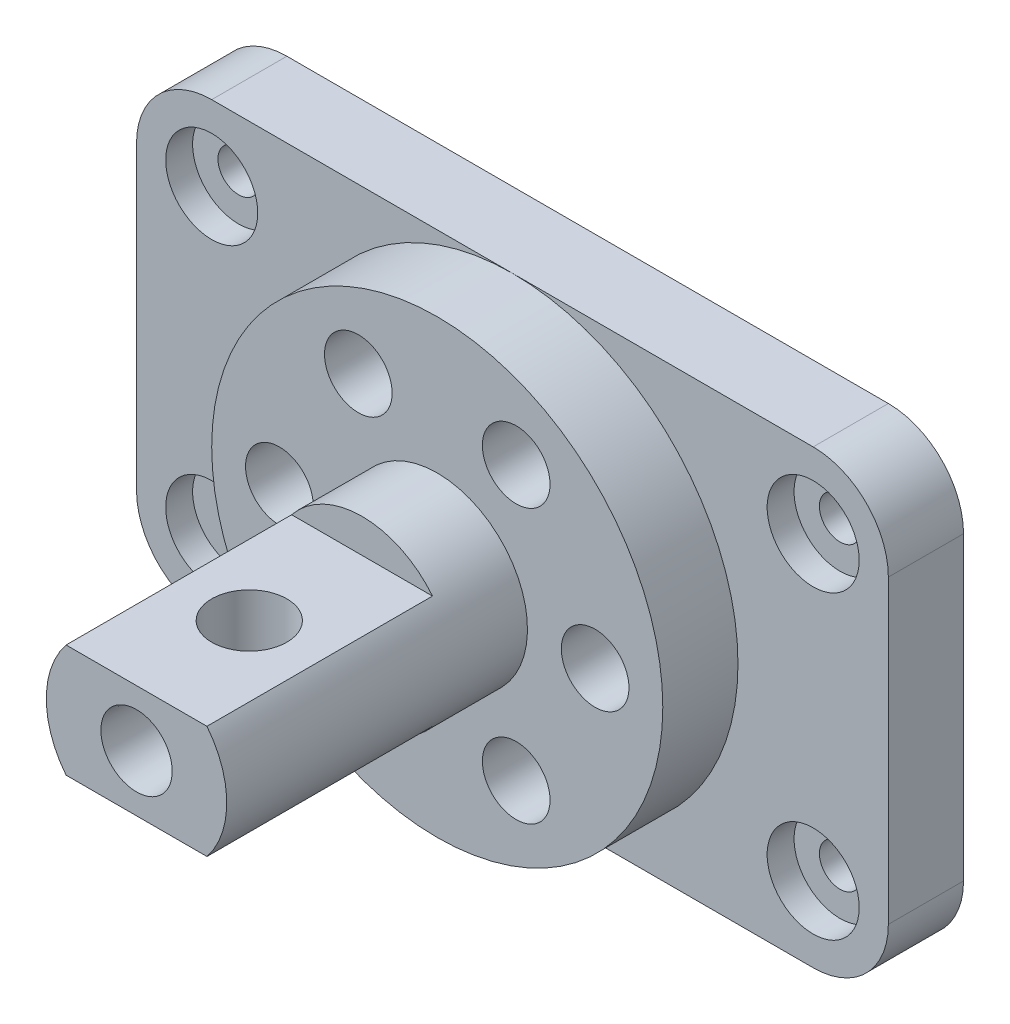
ISO-10303-21;
HEADER;
FILE_DESCRIPTION(('STEP AP214'),'2;1');
FILE_NAME('part.step','',(''),(''),'','','');
FILE_SCHEMA(('AUTOMOTIVE_DESIGN { 1 0 10303 214 1 1 1 1 }'));
ENDSEC;
DATA;
#1=APPLICATION_CONTEXT('core data for automotive mechanical design processes');
#2=APPLICATION_PROTOCOL_DEFINITION('international standard','automotive_design',2000,#1);
#3=PRODUCT_CONTEXT('',#1,'mechanical');
#4=PRODUCT('Part','Part','',(#3));
#5=PRODUCT_RELATED_PRODUCT_CATEGORY('part','',(#4));
#6=PRODUCT_DEFINITION_FORMATION('','',#4);
#7=PRODUCT_DEFINITION_CONTEXT('part definition',#1,'design');
#8=PRODUCT_DEFINITION('design','',#6,#7);
#9=PRODUCT_DEFINITION_SHAPE('','',#8);
#10=(LENGTH_UNIT() NAMED_UNIT(*) SI_UNIT(.MILLI.,.METRE.));
#11=(NAMED_UNIT(*) PLANE_ANGLE_UNIT() SI_UNIT($,.RADIAN.));
#12=(NAMED_UNIT(*) SI_UNIT($,.STERADIAN.) SOLID_ANGLE_UNIT());
#13=UNCERTAINTY_MEASURE_WITH_UNIT(LENGTH_MEASURE(1.E-05),#10,'distance_accuracy_value','');
#14=(GEOMETRIC_REPRESENTATION_CONTEXT(3) GLOBAL_UNCERTAINTY_ASSIGNED_CONTEXT((#13)) GLOBAL_UNIT_ASSIGNED_CONTEXT((#10,
#11,#12)) REPRESENTATION_CONTEXT('',''));
#15=CARTESIAN_POINT('',(0.,0.,0.));
#16=DIRECTION('',(0.,0.,1.));
#17=DIRECTION('',(1.,0.,0.));
#18=AXIS2_PLACEMENT_3D('',#15,#16,#17);
#19=CARTESIAN_POINT('',(0.,0.,-11.6));
#20=DIRECTION('',(0.,0.,1.));
#21=DIRECTION('',(1.,0.,0.));
#22=AXIS2_PLACEMENT_3D('',#19,#20,#21);
#23=CONICAL_SURFACE('',#22,4.21640000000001,1.02974425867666);
#24=CARTESIAN_POINT('',(0.,0.,-11.6));
#25=DIRECTION('',(0.,0.,1.));
#26=DIRECTION('',(1.,0.,0.));
#27=AXIS2_PLACEMENT_3D('',#24,#25,#26);
#28=CIRCLE('',#27,4.21640000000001);
#29=CARTESIAN_POINT('',(3.66606055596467,-2.0827935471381,-11.6));
#30=VERTEX_POINT('',#29);
#31=CARTESIAN_POINT('',(3.66606055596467,2.0827935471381,-11.6));
#32=VERTEX_POINT('',#31);
#33=EDGE_CURVE('E290',#30,#32,#28,.T.);
#34=ORIENTED_EDGE('',*,*,#33,.T.);
#35=CARTESIAN_POINT('',(2.27416541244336,5.51846547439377,-10.5471164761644));
#36=CARTESIAN_POINT('',(2.33273519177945,5.44045904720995,-10.577038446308));
#37=CARTESIAN_POINT('',(2.38907450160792,5.36093973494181,-10.6072590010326));
#38=CARTESIAN_POINT('',(2.49758718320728,5.1992810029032,-10.6680325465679));
#39=CARTESIAN_POINT('',(2.54976236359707,5.1171427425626,-10.6985853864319));
#40=CARTESIAN_POINT('',(2.70042501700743,4.86752245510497,-10.7903047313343));
#41=CARTESIAN_POINT('',(2.79320209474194,4.69662760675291,-10.8516121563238));
#42=CARTESIAN_POINT('',(2.96451492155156,4.34947283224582,-10.9722826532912));
#43=CARTESIAN_POINT('',(3.04317621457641,4.17327835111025,-11.0316585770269));
#44=CARTESIAN_POINT('',(3.1886350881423,3.81514904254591,-11.1475660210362));
#45=CARTESIAN_POINT('',(3.25543287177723,3.63321431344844,-11.2040975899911));
#46=CARTESIAN_POINT('',(3.35062830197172,3.34680427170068,-11.288485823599));
#47=CARTESIAN_POINT('',(3.38285221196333,3.24402401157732,-11.3178730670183));
#48=CARTESIAN_POINT('',(3.47120141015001,2.94511647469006,-11.4004142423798));
#49=CARTESIAN_POINT('',(3.52313886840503,2.74714991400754,-11.4514979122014));
#50=CARTESIAN_POINT('',(3.61577771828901,2.34670455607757,-11.545940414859));
#51=CARTESIAN_POINT('',(3.65647438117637,2.14422389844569,-11.5892959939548));
#52=CARTESIAN_POINT('',(3.72672907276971,1.73536053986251,-11.6662020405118));
#53=CARTESIAN_POINT('',(3.75628117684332,1.52897582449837,-11.6997472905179));
#54=CARTESIAN_POINT('',(3.80412046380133,1.11330762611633,-11.7550004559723));
#55=CARTESIAN_POINT('',(3.82240905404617,0.904024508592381,-11.7767098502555));
#56=CARTESIAN_POINT('',(3.84228620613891,0.57211899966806,-11.8004764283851));
#57=CARTESIAN_POINT('',(3.84766268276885,0.450017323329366,-11.8069580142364));
#58=CARTESIAN_POINT('',(3.85455860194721,0.205550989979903,-11.8152847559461));
#59=CARTESIAN_POINT('',(3.85607839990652,0.0831863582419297,-11.8171303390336));
#60=CARTESIAN_POINT('',(3.85525414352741,-0.161543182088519,-11.8161318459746));
#61=CARTESIAN_POINT('',(3.85290907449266,-0.283908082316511,-11.8132865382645));
#62=CARTESIAN_POINT('',(3.84436433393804,-0.528304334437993,-11.8029855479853));
#63=CARTESIAN_POINT('',(3.8381644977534,-0.650335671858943,-11.7955296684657));
#64=CARTESIAN_POINT('',(3.81382641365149,-1.01529886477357,-11.7665172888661));
#65=CARTESIAN_POINT('',(3.78994862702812,-1.25736416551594,-11.7383143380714));
#66=CARTESIAN_POINT('',(3.72713147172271,-1.73709849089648,-11.6667249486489));
#67=CARTESIAN_POINT('',(3.68819644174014,-1.97476876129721,-11.6233428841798));
#68=CARTESIAN_POINT('',(3.61056917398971,-2.36743745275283,-11.5408305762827));
#69=CARTESIAN_POINT('',(3.57599189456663,-2.52396590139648,-11.5049785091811));
#70=CARTESIAN_POINT('',(3.4999412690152,-2.83434755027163,-11.4288223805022));
#71=CARTESIAN_POINT('',(3.45846369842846,-2.98819904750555,-11.3885155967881));
#72=CARTESIAN_POINT('',(3.35556532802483,-3.33635821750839,-11.2923778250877));
#73=CARTESIAN_POINT('',(3.29183193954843,-3.52967114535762,-11.2354008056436));
#74=CARTESIAN_POINT('',(3.15184747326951,-3.9106128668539,-11.117443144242));
#75=CARTESIAN_POINT('',(3.07558891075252,-4.09823818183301,-11.0564601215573));
#76=CARTESIAN_POINT('',(2.90954761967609,-4.46612374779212,-10.9324138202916));
#77=CARTESIAN_POINT('',(2.81979827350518,-4.64640081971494,-10.8693559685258));
#78=CARTESIAN_POINT('',(2.62492088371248,-4.9981786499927,-10.7428533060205));
#79=CARTESIAN_POINT('',(2.51981012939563,-5.16968898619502,-10.6794090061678));
#80=CARTESIAN_POINT('',(2.35618058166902,-5.40742082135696,-10.5896030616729));
#81=CARTESIAN_POINT('',(2.30488914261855,-5.47838278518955,-10.5625416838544));
#82=CARTESIAN_POINT('',(2.19864454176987,-5.61775223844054,-10.5089542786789));
#83=CARTESIAN_POINT('',(2.14369029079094,-5.68615895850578,-10.4824284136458));
#84=CARTESIAN_POINT('',(2.08677603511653,-5.75309601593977,-10.4562828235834));
#85=B_SPLINE_CURVE_WITH_KNOTS('',3,(#35,#36,#37,#38,#39,#40,#41,#42,#43,#44,#45,#46,#47,#48,#49,
#50,#51,#52,#53,#54,#55,#56,#57,#58,#59,#60,#61,#62,#63,#64,#65,#66,#67,#68,#69,#70,#71,#72,#73,
#74,#75,#76,#77,#78,#79,#80,#81,#82,#83,#84),.UNSPECIFIED.,.F.,.F.,(4,2,2,2,2,2,2,2,2,2,2,2,2,2,
2,2,2,2,2,2,2,2,2,2,4),(0.,0.30600535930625,0.611877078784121,1.22281494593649,1.8280161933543,
2.43320707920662,2.76811073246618,3.40043176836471,4.03301840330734,4.66594085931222,
5.29878421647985,5.66582854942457,6.03283905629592,6.39994593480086,6.76706849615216,
7.50052421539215,8.2337687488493,8.72634080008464,9.21921552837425,9.85285286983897,
10.4868702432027,11.1193438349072,11.7511109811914,12.0259486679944,12.300868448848),.UNSPECIFIED.);
#86=EDGE_CURVE('E55',#32,#30,#85,.T.);
#87=ORIENTED_EDGE('',*,*,#86,.T.);
#88=EDGE_LOOP('',(#34,#87));
#89=FACE_BOUND('',#88,.T.);
#90=ADVANCED_FACE('F33',(#89),#23,.F.);
#91=CARTESIAN_POINT('',(0.,0.,0.));
#92=DIRECTION('',(0.,0.,1.));
#93=DIRECTION('',(0.,-1.,0.));
#94=AXIS2_PLACEMENT_3D('',#91,#92,#93);
#95=PLANE('',#94);
#96=DIRECTION('',(1.,0.,0.));
#97=VECTOR('',#96,1.);
#98=CARTESIAN_POINT('',(9.36749699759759,7.5,0.));
#99=LINE('',#98,#97);
#100=CARTESIAN_POINT('',(-9.36749699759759,7.5,0.));
#101=VERTEX_POINT('',#100);
#102=CARTESIAN_POINT('',(9.36749699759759,7.5,0.));
#103=VERTEX_POINT('',#102);
#104=EDGE_CURVE('E433',#101,#103,#99,.T.);
#105=ORIENTED_EDGE('',*,*,#104,.F.);
#106=CARTESIAN_POINT('',(0.,0.,0.));
#107=DIRECTION('',(0.,0.,-1.));
#108=DIRECTION('',(0.,1.,0.));
#109=AXIS2_PLACEMENT_3D('',#106,#107,#108);
#110=CIRCLE('',#109,12.);
#111=CARTESIAN_POINT('',(-9.36749699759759,-7.5,0.));
#112=VERTEX_POINT('',#111);
#113=EDGE_CURVE('E11',#112,#101,#110,.T.);
#114=ORIENTED_EDGE('',*,*,#113,.F.);
#115=DIRECTION('',(-1.,0.,0.));
#116=VECTOR('',#115,1.);
#117=CARTESIAN_POINT('',(9.36749699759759,-7.5,0.));
#118=LINE('',#117,#116);
#119=CARTESIAN_POINT('',(9.36749699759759,-7.5,0.));
#120=VERTEX_POINT('',#119);
#121=EDGE_CURVE('E325',#120,#112,#118,.T.);
#122=ORIENTED_EDGE('',*,*,#121,.F.);
#123=EDGE_CURVE('E41',#103,#120,#110,.T.);
#124=ORIENTED_EDGE('',*,*,#123,.F.);
#125=EDGE_LOOP('',(#105,#114,#122,#124));
#126=FACE_BOUND('',#125,.T.);
#127=CARTESIAN_POINT('',(0.,0.,0.));
#128=DIRECTION('',(0.,0.,1.));
#129=DIRECTION('',(1.,0.,0.));
#130=AXIS2_PLACEMENT_3D('',#127,#128,#129);
#131=CIRCLE('',#130,4.7439961);
#132=CARTESIAN_POINT('',(4.7439961,0.,0.));
#133=VERTEX_POINT('',#132);
#134=EDGE_CURVE('E377',#133,#133,#131,.T.);
#135=ORIENTED_EDGE('',*,*,#134,.F.);
#136=EDGE_LOOP('',(#135));
#137=FACE_BOUND('',#136,.T.);
#138=ADVANCED_FACE('F35',(#126,#137),#95,.T.);
#139=CARTESIAN_POINT('',(0.,0.,-50.));
#140=DIRECTION('',(0.,0.,-1.));
#141=DIRECTION('',(0.,1.,0.));
#142=AXIS2_PLACEMENT_3D('',#139,#140,#141);
#143=CYLINDRICAL_SURFACE('',#142,12.);
#144=DIRECTION('',(0.,0.,1.));
#145=VECTOR('',#144,1.);
#146=CARTESIAN_POINT('',(-9.36749699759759,7.5,-30.));
#147=LINE('',#146,#145);
#148=CARTESIAN_POINT('',(-9.36749699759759,7.5,-30.));
#149=VERTEX_POINT('',#148);
#150=EDGE_CURVE('E335',#149,#101,#147,.T.);
#151=ORIENTED_EDGE('',*,*,#150,.F.);
#152=CARTESIAN_POINT('',(0.,0.,-30.));
#153=DIRECTION('',(0.,0.,1.));
#154=DIRECTION('',(1.,0.,0.));
#155=AXIS2_PLACEMENT_3D('',#152,#153,#154);
#156=CIRCLE('',#155,12.);
#157=CARTESIAN_POINT('',(9.36749699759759,7.5,-30.));
#158=VERTEX_POINT('',#157);
#159=EDGE_CURVE('E435',#158,#149,#156,.T.);
#160=ORIENTED_EDGE('',*,*,#159,.F.);
#161=DIRECTION('',(0.,0.,1.));
#162=VECTOR('',#161,1.);
#163=CARTESIAN_POINT('',(9.36749699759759,7.5,-30.));
#164=LINE('',#163,#162);
#165=EDGE_CURVE('E318',#158,#103,#164,.T.);
#166=ORIENTED_EDGE('',*,*,#165,.T.);
#167=ORIENTED_EDGE('',*,*,#123,.T.);
#168=DIRECTION('',(0.,0.,1.));
#169=VECTOR('',#168,1.);
#170=CARTESIAN_POINT('',(9.36749699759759,-7.5,-30.));
#171=LINE('',#170,#169);
#172=CARTESIAN_POINT('',(9.36749699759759,-7.5,-30.));
#173=VERTEX_POINT('',#172);
#174=EDGE_CURVE('E315',#173,#120,#171,.T.);
#175=ORIENTED_EDGE('',*,*,#174,.F.);
#176=CARTESIAN_POINT('',(0.,0.,-30.));
#177=DIRECTION('',(0.,0.,1.));
#178=DIRECTION('',(1.,0.,0.));
#179=AXIS2_PLACEMENT_3D('',#176,#177,#178);
#180=CIRCLE('',#179,12.);
#181=CARTESIAN_POINT('',(-9.36749699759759,-7.5,-30.));
#182=VERTEX_POINT('',#181);
#183=EDGE_CURVE('E332',#182,#173,#180,.T.);
#184=ORIENTED_EDGE('',*,*,#183,.F.);
#185=DIRECTION('',(0.,0.,1.));
#186=VECTOR('',#185,1.);
#187=CARTESIAN_POINT('',(-9.36749699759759,-7.5,-30.));
#188=LINE('',#187,#186);
#189=EDGE_CURVE('E328',#182,#112,#188,.T.);
#190=ORIENTED_EDGE('',*,*,#189,.T.);
#191=ORIENTED_EDGE('',*,*,#113,.T.);
#192=EDGE_LOOP('',(#151,#160,#166,#167,#175,#184,#190,#191));
#193=FACE_BOUND('',#192,.T.);
#194=CARTESIAN_POINT('',(0.,0.,-40.));
#195=DIRECTION('',(0.,0.,-1.));
#196=DIRECTION('',(0.,1.,0.));
#197=AXIS2_PLACEMENT_3D('',#194,#195,#196);
#198=CIRCLE('',#197,12.);
#199=CARTESIAN_POINT('',(0.,12.,-40.));
#200=VERTEX_POINT('',#199);
#201=EDGE_CURVE('E306',#200,#200,#198,.T.);
#202=ORIENTED_EDGE('',*,*,#201,.F.);
#203=EDGE_LOOP('',(#202));
#204=FACE_BOUND('',#203,.T.);
#205=ADVANCED_FACE('F274',(#193,#204),#143,.T.);
#206=CARTESIAN_POINT('',(0.,12.,-40.));
#207=DIRECTION('',(0.,0.,1.));
#208=DIRECTION('',(0.,-1.,0.));
#209=AXIS2_PLACEMENT_3D('',#206,#207,#208);
#210=PLANE('',#209);
#211=CARTESIAN_POINT('',(10.5000000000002,-18.1865334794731,-40.));
#212=DIRECTION('',(0.,0.,1.));
#213=DIRECTION('',(1.,0.,0.));
#214=AXIS2_PLACEMENT_3D('',#211,#212,#213);
#215=CIRCLE('',#214,4.49999999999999);
#216=CARTESIAN_POINT('',(15.0000000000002,-18.1865334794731,-40.));
#217=VERTEX_POINT('',#216);
#218=EDGE_CURVE('E340',#217,#217,#215,.T.);
#219=ORIENTED_EDGE('',*,*,#218,.F.);
#220=EDGE_LOOP('',(#219));
#221=FACE_BOUND('',#220,.T.);
#222=CARTESIAN_POINT('',(-10.4999999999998,-18.1865334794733,-40.));
#223=DIRECTION('',(0.,0.,1.));
#224=DIRECTION('',(1.,0.,0.));
#225=AXIS2_PLACEMENT_3D('',#222,#223,#224);
#226=CIRCLE('',#225,4.49999999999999);
#227=CARTESIAN_POINT('',(-5.99999999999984,-18.1865334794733,-40.));
#228=VERTEX_POINT('',#227);
#229=EDGE_CURVE('E347',#228,#228,#226,.T.);
#230=ORIENTED_EDGE('',*,*,#229,.F.);
#231=EDGE_LOOP('',(#230));
#232=FACE_BOUND('',#231,.T.);
#233=CARTESIAN_POINT('',(-21.,-1.46733009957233E-13,-40.));
#234=DIRECTION('',(0.,0.,1.));
#235=DIRECTION('',(1.,0.,0.));
#236=AXIS2_PLACEMENT_3D('',#233,#234,#235);
#237=CIRCLE('',#236,4.49999999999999);
#238=CARTESIAN_POINT('',(-16.5,-1.46733009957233E-13,-40.));
#239=VERTEX_POINT('',#238);
#240=EDGE_CURVE('E353',#239,#239,#237,.T.);
#241=ORIENTED_EDGE('',*,*,#240,.F.);
#242=EDGE_LOOP('',(#241));
#243=FACE_BOUND('',#242,.T.);
#244=CARTESIAN_POINT('',(-10.5000000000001,18.1865334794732,-40.));
#245=DIRECTION('',(0.,0.,1.));
#246=DIRECTION('',(1.,0.,0.));
#247=AXIS2_PLACEMENT_3D('',#244,#245,#246);
#248=CIRCLE('',#247,4.49999999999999);
#249=CARTESIAN_POINT('',(-6.0000000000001,18.1865334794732,-40.));
#250=VERTEX_POINT('',#249);
#251=EDGE_CURVE('E359',#250,#250,#248,.T.);
#252=ORIENTED_EDGE('',*,*,#251,.F.);
#253=EDGE_LOOP('',(#252));
#254=FACE_BOUND('',#253,.T.);
#255=CARTESIAN_POINT('',(10.5,18.1865334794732,-40.));
#256=DIRECTION('',(0.,0.,1.));
#257=DIRECTION('',(1.,0.,0.));
#258=AXIS2_PLACEMENT_3D('',#255,#256,#257);
#259=CIRCLE('',#258,4.49999999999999);
#260=CARTESIAN_POINT('',(14.9999999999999,18.1865334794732,-40.));
#261=VERTEX_POINT('',#260);
#262=EDGE_CURVE('E365',#261,#261,#259,.T.);
#263=ORIENTED_EDGE('',*,*,#262,.F.);
#264=EDGE_LOOP('',(#263));
#265=FACE_BOUND('',#264,.T.);
#266=CARTESIAN_POINT('',(21.,0.,-40.));
#267=DIRECTION('',(0.,0.,1.));
#268=DIRECTION('',(1.,0.,0.));
#269=AXIS2_PLACEMENT_3D('',#266,#267,#268);
#270=CIRCLE('',#269,4.49999999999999);
#271=CARTESIAN_POINT('',(25.5,0.,-40.));
#272=VERTEX_POINT('',#271);
#273=EDGE_CURVE('E371',#272,#272,#270,.T.);
#274=ORIENTED_EDGE('',*,*,#273,.F.);
#275=EDGE_LOOP('',(#274));
#276=FACE_BOUND('',#275,.T.);
#277=ORIENTED_EDGE('',*,*,#201,.T.);
#278=EDGE_LOOP('',(#277));
#279=FACE_BOUND('',#278,.T.);
#280=CARTESIAN_POINT('',(0.,0.,-40.));
#281=DIRECTION('',(0.,0.,-1.));
#282=DIRECTION('',(0.,1.,0.));
#283=AXIS2_PLACEMENT_3D('',#280,#281,#282);
#284=CIRCLE('',#283,30.);
#285=CARTESIAN_POINT('',(0.,30.,-40.));
#286=VERTEX_POINT('',#285);
#287=EDGE_CURVE('E304',#286,#286,#284,.T.);
#288=ORIENTED_EDGE('',*,*,#287,.F.);
#289=EDGE_LOOP('',(#288));
#290=FACE_BOUND('',#289,.T.);
#291=ADVANCED_FACE('F271',(#221,#232,#243,#254,#265,#276,#279,#290),#210,.T.);
#292=CARTESIAN_POINT('',(0.,0.,-50.));
#293=DIRECTION('',(0.,0.,-1.));
#294=DIRECTION('',(0.,1.,0.));
#295=AXIS2_PLACEMENT_3D('',#292,#293,#294);
#296=CYLINDRICAL_SURFACE('',#295,30.);
#297=ORIENTED_EDGE('',*,*,#287,.T.);
#298=EDGE_LOOP('',(#297));
#299=FACE_BOUND('',#298,.T.);
#300=CARTESIAN_POINT('',(0.,0.,-50.));
#301=DIRECTION('',(0.,0.,-1.));
#302=DIRECTION('',(0.,1.,0.));
#303=AXIS2_PLACEMENT_3D('',#300,#301,#302);
#304=CIRCLE('',#303,30.);
#305=CARTESIAN_POINT('',(0.,30.,-50.));
#306=VERTEX_POINT('',#305);
#307=CARTESIAN_POINT('',(0.,-30.,-50.));
#308=VERTEX_POINT('',#307);
#309=EDGE_CURVE('E302',#306,#308,#304,.T.);
#310=ORIENTED_EDGE('',*,*,#309,.F.);
#311=EDGE_CURVE('E47',#308,#306,#304,.T.);
#312=ORIENTED_EDGE('',*,*,#311,.F.);
#313=EDGE_LOOP('',(#310,#312));
#314=FACE_BOUND('',#313,.T.);
#315=ADVANCED_FACE('F266',(#299,#314),#296,.T.);
#316=CARTESIAN_POINT('',(-3.66606055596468,2.08279354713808,-11.6));
#317=VERTEX_POINT('',#316);
#318=CARTESIAN_POINT('',(-3.66606055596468,-2.08279354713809,-11.6));
#319=VERTEX_POINT('',#318);
#320=EDGE_CURVE('E293',#317,#319,#28,.T.);
#321=ORIENTED_EDGE('',*,*,#320,.T.);
#322=CARTESIAN_POINT('',(-2.08677603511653,-5.75309601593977,-10.4562828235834));
#323=CARTESIAN_POINT('',(-2.14176783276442,-5.68842009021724,-10.4815451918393));
#324=CARTESIAN_POINT('',(-2.19493167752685,-5.62236975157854,-10.5071635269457));
#325=CARTESIAN_POINT('',(-2.29782279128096,-5.48788061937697,-10.5589035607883));
#326=CARTESIAN_POINT('',(-2.34755156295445,-5.41944289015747,-10.5850250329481));
#327=CARTESIAN_POINT('',(-2.49181802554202,-5.21124081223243,-10.663774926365));
#328=CARTESIAN_POINT('',(-2.58162367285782,-5.06836240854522,-10.7168772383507));
#329=CARTESIAN_POINT('',(-2.74940527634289,-4.77735896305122,-10.8226185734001));
#330=CARTESIAN_POINT('',(-2.82746716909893,-4.62928291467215,-10.8752580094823));
#331=CARTESIAN_POINT('',(-2.97375748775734,-4.32794268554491,-10.9794493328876));
#332=CARTESIAN_POINT('',(-3.0419831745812,-4.1746770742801,-11.0310009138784));
#333=CARTESIAN_POINT('',(-3.16427128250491,-3.87632866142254,-11.1279245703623));
#334=CARTESIAN_POINT('',(-3.21903230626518,-3.73158336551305,-11.173459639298));
#335=CARTESIAN_POINT('',(-3.32149194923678,-3.43856766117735,-11.2620481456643));
#336=CARTESIAN_POINT('',(-3.36917797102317,-3.29029149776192,-11.305097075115));
#337=CARTESIAN_POINT('',(-3.47123713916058,-2.94499025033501,-11.4004485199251));
#338=CARTESIAN_POINT('',(-3.52319990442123,-2.74691614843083,-11.451558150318));
#339=CARTESIAN_POINT('',(-3.61587125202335,-2.34627012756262,-11.5460377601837));
#340=CARTESIAN_POINT('',(-3.65657684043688,-2.14369702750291,-11.589405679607));
#341=CARTESIAN_POINT('',(-3.72680662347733,-1.73483963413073,-11.6662894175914));
#342=CARTESIAN_POINT('',(-3.75633527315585,-1.52855685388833,-11.6998091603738));
#343=CARTESIAN_POINT('',(-3.80413894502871,-1.11309595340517,-11.7550224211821));
#344=CARTESIAN_POINT('',(-3.82241541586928,-0.903918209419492,-11.7767174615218));
#345=CARTESIAN_POINT('',(-3.84228320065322,-0.572169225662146,-11.8004728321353));
#346=CARTESIAN_POINT('',(-3.84765824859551,-0.450118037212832,-11.8069526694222));
#347=CARTESIAN_POINT('',(-3.85455450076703,-0.205752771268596,-11.815279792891));
#348=CARTESIAN_POINT('',(-3.85607606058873,-0.0834387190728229,-11.8171275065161));
#349=CARTESIAN_POINT('',(-3.85525851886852,0.161188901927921,-11.8161371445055));
#350=CARTESIAN_POINT('',(-3.85291843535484,0.28350246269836,-11.813297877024));
#351=CARTESIAN_POINT('',(-3.84438688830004,0.527796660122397,-11.8030126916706));
#352=CARTESIAN_POINT('',(-3.83819526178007,0.649777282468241,-11.7955665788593));
#353=CARTESIAN_POINT('',(-3.81387293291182,1.01479451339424,-11.7665722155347));
#354=CARTESIAN_POINT('',(-3.78999457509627,1.25696387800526,-11.7383675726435));
#355=CARTESIAN_POINT('',(-3.72716357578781,1.73690268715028,-11.6667606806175));
#356=CARTESIAN_POINT('',(-3.68821540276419,1.97467341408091,-11.6233629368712));
#357=CARTESIAN_POINT('',(-3.61054085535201,2.36758031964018,-11.5408005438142));
#358=CARTESIAN_POINT('',(-3.57592924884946,2.52424807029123,-11.5049137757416));
#359=CARTESIAN_POINT('',(-3.49986515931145,2.83463163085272,-11.4287481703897));
#360=CARTESIAN_POINT('',(-3.4584209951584,2.988350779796,-11.3884746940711));
#361=CARTESIAN_POINT('',(-3.38850870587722,3.22488947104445,-11.3231573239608));
#362=CARTESIAN_POINT('',(-3.36248812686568,3.30877800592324,-11.2993242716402));
#363=CARTESIAN_POINT('',(-3.30821189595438,3.47557569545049,-11.2507253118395));
#364=CARTESIAN_POINT('',(-3.27995578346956,3.5584846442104,-11.2259592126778));
#365=CARTESIAN_POINT('',(-3.19086884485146,3.80808368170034,-11.1497359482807));
#366=CARTESIAN_POINT('',(-3.12645338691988,3.97314278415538,-11.0970522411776));
#367=CARTESIAN_POINT('',(-2.98742235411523,4.2982179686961,-10.989634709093));
#368=CARTESIAN_POINT('',(-2.91280694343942,4.45823413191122,-10.9349009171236));
#369=CARTESIAN_POINT('',(-2.75193804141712,4.77292678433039,-10.8243063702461));
#370=CARTESIAN_POINT('',(-2.66563633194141,4.9275776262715,-10.7684418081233));
#371=CARTESIAN_POINT('',(-2.52651655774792,5.1538256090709,-10.6849521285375));
#372=CARTESIAN_POINT('',(-2.47850117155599,5.22832879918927,-10.6571572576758));
#373=CARTESIAN_POINT('',(-2.37899693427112,5.375130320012,-10.6018638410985));
#374=CARTESIAN_POINT('',(-2.32750686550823,5.44742786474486,-10.5743654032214));
#375=CARTESIAN_POINT('',(-2.27416541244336,5.51846547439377,-10.5471164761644));
#376=B_SPLINE_CURVE_WITH_KNOTS('',3,(#322,#323,#324,#325,#326,#327,#328,#329,#330,#331,#332,
#333,#334,#335,#336,#337,#338,#339,#340,#341,#342,#343,#344,#345,#346,#347,#348,#349,#350,#351,
#352,#353,#354,#355,#356,#357,#358,#359,#360,#361,#362,#363,#364,#365,#366,#367,#368,#369,#370,
#371,#372,#373,#374,#375),.UNSPECIFIED.,.F.,.F.,(4,2,2,2,2,2,2,2,2,2,2,2,2,2,2,2,2,2,2,2,2,2,2,
2,2,2,4),(0.,0.265642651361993,0.531168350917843,1.06130435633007,1.58734955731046,
2.11354096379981,2.59727769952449,3.08186567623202,3.71455461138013,4.34741165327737,
4.98001617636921,5.61253923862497,5.97943222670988,6.34629135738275,6.71324379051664,
7.08021175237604,7.81397623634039,8.54752331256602,9.04054464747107,9.53297008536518,
9.80595960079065,10.079005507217,10.6331865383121,11.1873586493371,11.7438912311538,
12.0224836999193,12.301174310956),.UNSPECIFIED.);
#377=EDGE_CURVE('E232',#319,#317,#376,.T.);
#378=ORIENTED_EDGE('',*,*,#377,.T.);
#379=EDGE_LOOP('',(#321,#378));
#380=FACE_BOUND('',#379,.T.);
#381=ADVANCED_FACE('F262',(#380),#23,.F.);
#382=CARTESIAN_POINT('',(0.,0.,0.));
#383=DIRECTION('',(0.,0.,1.));
#384=DIRECTION('',(1.,0.,0.));
#385=AXIS2_PLACEMENT_3D('',#382,#383,#384);
#386=CYLINDRICAL_SURFACE('',#385,4.21640000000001);
#387=ORIENTED_EDGE('',*,*,#33,.F.);
#388=CARTESIAN_POINT('',(3.66606055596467,-2.08279354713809,-11.6));
#389=CARTESIAN_POINT('',(3.63428948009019,-2.13870921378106,-11.5657403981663));
#390=CARTESIAN_POINT('',(3.60133250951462,-2.19374726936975,-11.5311700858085));
#391=CARTESIAN_POINT('',(3.53305797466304,-2.3020939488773,-11.4616569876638));
#392=CARTESIAN_POINT('',(3.49774049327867,-2.35540263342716,-11.4267142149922));
#393=CARTESIAN_POINT('',(3.38820766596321,-2.51285520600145,-11.3216461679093));
#394=CARTESIAN_POINT('',(3.31045805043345,-2.61444458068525,-11.2513315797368));
#395=CARTESIAN_POINT('',(3.1448749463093,-2.81149247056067,-11.1113471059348));
#396=CARTESIAN_POINT('',(3.05695982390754,-2.90689014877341,-11.0416881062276));
#397=CARTESIAN_POINT('',(2.8716304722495,-3.09010351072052,-10.9052493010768));
#398=CARTESIAN_POINT('',(2.7742203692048,-3.17792245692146,-10.8384682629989));
#399=CARTESIAN_POINT('',(2.51009985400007,-3.39429393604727,-10.6714833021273));
#400=CARTESIAN_POINT('',(2.33613093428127,-3.51669681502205,-10.5745270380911));
#401=CARTESIAN_POINT('',(1.96568519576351,-3.73633669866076,-10.3980492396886));
#402=CARTESIAN_POINT('',(1.76929219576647,-3.83366326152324,-10.3184658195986));
#403=CARTESIAN_POINT('',(1.39137062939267,-3.98450280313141,-10.1940930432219));
#404=CARTESIAN_POINT('',(1.21288530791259,-4.04262896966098,-10.1457048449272));
#405=CARTESIAN_POINT('',(0.845668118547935,-4.13505246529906,-10.0684708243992));
#406=CARTESIAN_POINT('',(0.656937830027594,-4.16935345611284,-10.0396219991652));
#407=CARTESIAN_POINT('',(0.273766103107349,-4.21192964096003,-10.0037826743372));
#408=CARTESIAN_POINT('',(0.0793066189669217,-4.22011111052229,-9.99687089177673));
#409=CARTESIAN_POINT('',(-0.308345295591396,-4.20957791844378,-10.005752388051));
#410=CARTESIAN_POINT('',(-0.501537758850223,-4.19086395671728,-10.0215450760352));
#411=CARTESIAN_POINT('',(-0.86923613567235,-4.12978626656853,-10.0728452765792));
#412=CARTESIAN_POINT('',(-1.04416881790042,-4.08890267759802,-10.1071182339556));
#413=CARTESIAN_POINT('',(-1.38369405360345,-3.98683863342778,-10.1920837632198));
#414=CARTESIAN_POINT('',(-1.54828586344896,-3.92565672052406,-10.2427775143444));
#415=CARTESIAN_POINT('',(-1.9177733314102,-3.76212011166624,-10.3769450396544));
#416=CARTESIAN_POINT('',(-2.11767546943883,-3.65283861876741,-10.4657106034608));
#417=CARTESIAN_POINT('',(-2.49237892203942,-3.40828847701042,-10.660316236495));
#418=CARTESIAN_POINT('',(-2.66708813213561,-3.27292849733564,-10.7662160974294));
#419=CARTESIAN_POINT('',(-2.91294132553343,-3.05053390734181,-10.9348709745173));
#420=CARTESIAN_POINT('',(-2.99374597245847,-2.97123173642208,-10.9941213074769));
#421=CARTESIAN_POINT('',(-3.148186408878,-2.80707099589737,-11.1143220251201));
#422=CARTESIAN_POINT('',(-3.22182135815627,-2.72221177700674,-11.1752726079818));
#423=CARTESIAN_POINT('',(-3.36133539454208,-2.54790809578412,-11.2973076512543));
#424=CARTESIAN_POINT('',(-3.42727259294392,-2.45850645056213,-11.3583870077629));
#425=CARTESIAN_POINT('',(-3.55201547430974,-2.27453210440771,-11.479941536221));
#426=CARTESIAN_POINT('',(-3.61082367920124,-2.17996124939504,-11.5404169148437));
#427=CARTESIAN_POINT('',(-3.66606055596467,-2.08279354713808,-11.6));
#428=B_SPLINE_CURVE_WITH_KNOTS('',3,(#388,#389,#390,#391,#392,#393,#394,#395,#396,#397,#398,
#399,#400,#401,#402,#403,#404,#405,#406,#407,#408,#409,#410,#411,#412,#413,#414,#415,#416,#417,
#418,#419,#420,#421,#422,#423,#424,#425,#426,#427),.UNSPECIFIED.,.F.,.F.,(4,2,2,2,2,2,2,2,2,2,2,
2,2,2,2,2,2,2,2,4),(0.,0.218568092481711,0.437128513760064,0.874566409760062,1.3157994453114,
1.75684158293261,2.45535879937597,3.15134560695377,3.73044102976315,4.30944743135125,
4.89052915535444,5.47159575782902,6.01793788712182,6.56431925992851,7.29392559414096,
8.02613515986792,8.40921382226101,8.79233732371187,9.17235051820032,9.55222888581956),.UNSPECIFIED.);
#429=EDGE_CURVE('E257',#30,#319,#428,.T.);
#430=ORIENTED_EDGE('',*,*,#429,.T.);
#431=ORIENTED_EDGE('',*,*,#320,.F.);
#432=CARTESIAN_POINT('',(-3.66606055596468,2.08279354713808,-11.6));
#433=CARTESIAN_POINT('',(-3.63428948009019,2.13870921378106,-11.5657403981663));
#434=CARTESIAN_POINT('',(-3.60133250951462,2.19374726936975,-11.5311700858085));
#435=CARTESIAN_POINT('',(-3.53305797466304,2.30209394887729,-11.4616569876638));
#436=CARTESIAN_POINT('',(-3.49774049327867,2.35540263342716,-11.4267142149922));
#437=CARTESIAN_POINT('',(-3.38820766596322,2.51285520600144,-11.3216461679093));
#438=CARTESIAN_POINT('',(-3.31045805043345,2.61444458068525,-11.2513315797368));
#439=CARTESIAN_POINT('',(-3.1448749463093,2.81149247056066,-11.1113471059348));
#440=CARTESIAN_POINT('',(-3.05695982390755,2.9068901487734,-11.0416881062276));
#441=CARTESIAN_POINT('',(-2.8716304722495,3.09010351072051,-10.9052493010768));
#442=CARTESIAN_POINT('',(-2.7742203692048,3.17792245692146,-10.8384682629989));
#443=CARTESIAN_POINT('',(-2.51009985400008,3.39429393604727,-10.6714833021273));
#444=CARTESIAN_POINT('',(-2.33613093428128,3.51669681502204,-10.5745270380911));
#445=CARTESIAN_POINT('',(-1.96568519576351,3.73633669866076,-10.3980492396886));
#446=CARTESIAN_POINT('',(-1.76929219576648,3.83366326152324,-10.3184658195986));
#447=CARTESIAN_POINT('',(-1.39137062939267,3.98450280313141,-10.1940930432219));
#448=CARTESIAN_POINT('',(-1.2128853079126,4.04262896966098,-10.1457048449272));
#449=CARTESIAN_POINT('',(-0.84566811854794,4.13505246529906,-10.0684708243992));
#450=CARTESIAN_POINT('',(-0.656937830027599,4.16935345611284,-10.0396219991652));
#451=CARTESIAN_POINT('',(-0.273766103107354,4.21192964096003,-10.0037826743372));
#452=CARTESIAN_POINT('',(-0.0793066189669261,4.22011111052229,-9.99687089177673));
#453=CARTESIAN_POINT('',(0.308345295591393,4.20957791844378,-10.005752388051));
#454=CARTESIAN_POINT('',(0.50153775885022,4.19086395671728,-10.0215450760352));
#455=CARTESIAN_POINT('',(0.869236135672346,4.12978626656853,-10.0728452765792));
#456=CARTESIAN_POINT('',(1.04416881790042,4.08890267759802,-10.1071182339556));
#457=CARTESIAN_POINT('',(1.38369405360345,3.98683863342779,-10.1920837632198));
#458=CARTESIAN_POINT('',(1.54828586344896,3.92565672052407,-10.2427775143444));
#459=CARTESIAN_POINT('',(1.91777333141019,3.76212011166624,-10.3769450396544));
#460=CARTESIAN_POINT('',(2.11767546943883,3.65283861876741,-10.4657106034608));
#461=CARTESIAN_POINT('',(2.49237892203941,3.40828847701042,-10.660316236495));
#462=CARTESIAN_POINT('',(2.66708813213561,3.27292849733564,-10.7662160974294));
#463=CARTESIAN_POINT('',(2.91294132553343,3.05053390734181,-10.9348709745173));
#464=CARTESIAN_POINT('',(2.99374597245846,2.97123173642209,-10.9941213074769));
#465=CARTESIAN_POINT('',(3.148186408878,2.80707099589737,-11.1143220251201));
#466=CARTESIAN_POINT('',(3.22182135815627,2.72221177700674,-11.1752726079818));
#467=CARTESIAN_POINT('',(3.36133539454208,2.54790809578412,-11.2973076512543));
#468=CARTESIAN_POINT('',(3.42727259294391,2.45850645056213,-11.3583870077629));
#469=CARTESIAN_POINT('',(3.55201547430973,2.27453210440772,-11.479941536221));
#470=CARTESIAN_POINT('',(3.61082367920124,2.17996124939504,-11.5404169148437));
#471=CARTESIAN_POINT('',(3.66606055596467,2.08279354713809,-11.6));
#472=B_SPLINE_CURVE_WITH_KNOTS('',3,(#432,#433,#434,#435,#436,#437,#438,#439,#440,#441,#442,
#443,#444,#445,#446,#447,#448,#449,#450,#451,#452,#453,#454,#455,#456,#457,#458,#459,#460,#461,
#462,#463,#464,#465,#466,#467,#468,#469,#470,#471),.UNSPECIFIED.,.F.,.F.,(4,2,2,2,2,2,2,2,2,2,2,
2,2,2,2,2,2,2,2,4),(0.,0.218568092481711,0.437128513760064,0.874566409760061,1.3157994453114,
1.75684158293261,2.45535879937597,3.15134560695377,3.73044102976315,4.30944743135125,
4.89052915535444,5.47159575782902,6.01793788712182,6.56431925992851,7.29392559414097,
8.02613515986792,8.40921382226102,8.79233732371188,9.17235051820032,9.55222888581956),.UNSPECIFIED.);
#473=EDGE_CURVE('E225',#317,#32,#472,.T.);
#474=ORIENTED_EDGE('',*,*,#473,.T.);
#475=EDGE_LOOP('',(#387,#430,#431,#474));
#476=FACE_BOUND('',#475,.T.);
#477=CARTESIAN_POINT('',(0.,0.,-6.9));
#478=DIRECTION('',(0.,0.,1.));
#479=DIRECTION('',(1.,0.,0.));
#480=AXIS2_PLACEMENT_3D('',#477,#478,#479);
#481=CIRCLE('',#480,4.2164);
#482=CARTESIAN_POINT('',(4.2164,0.,-6.9));
#483=VERTEX_POINT('',#482);
#484=EDGE_CURVE('E294',#483,#483,#481,.T.);
#485=ORIENTED_EDGE('',*,*,#484,.T.);
#486=EDGE_LOOP('',(#485));
#487=FACE_BOUND('',#486,.T.);
#488=ADVANCED_FACE('F238',(#476,#487),#386,.F.);
#489=CARTESIAN_POINT('',(4.2164,0.,-6.9));
#490=DIRECTION('',(0.,0.,-1.));
#491=DIRECTION('',(-1.,0.,0.));
#492=AXIS2_PLACEMENT_3D('',#489,#490,#491);
#493=PLANE('',#492);
#494=ORIENTED_EDGE('',*,*,#484,.F.);
#495=EDGE_LOOP('',(#494));
#496=FACE_BOUND('',#495,.T.);
#497=CARTESIAN_POINT('',(0.,0.,-6.9));
#498=DIRECTION('',(0.,0.,1.));
#499=DIRECTION('',(1.,0.,0.));
#500=AXIS2_PLACEMENT_3D('',#497,#498,#499);
#501=CIRCLE('',#500,4.53740085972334);
#502=CARTESIAN_POINT('',(4.53740085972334,0.,-6.9));
#503=VERTEX_POINT('',#502);
#504=EDGE_CURVE('E298',#503,#503,#501,.T.);
#505=ORIENTED_EDGE('',*,*,#504,.T.);
#506=EDGE_LOOP('',(#505));
#507=FACE_BOUND('',#506,.T.);
#508=ADVANCED_FACE('F382',(#496,#507),#493,.F.);
#509=CARTESIAN_POINT('',(0.,0.,0.));
#510=DIRECTION('',(0.,0.,1.));
#511=DIRECTION('',(1.,0.,0.));
#512=AXIS2_PLACEMENT_3D('',#509,#510,#511);
#513=CONICAL_SURFACE('',#512,4.7439961,0.029932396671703);
#514=ORIENTED_EDGE('',*,*,#504,.F.);
#515=EDGE_LOOP('',(#514));
#516=FACE_BOUND('',#515,.T.);
#517=ORIENTED_EDGE('',*,*,#134,.T.);
#518=EDGE_LOOP('',(#517));
#519=FACE_BOUND('',#518,.T.);
#520=ADVANCED_FACE('F384',(#516,#519),#513,.F.);
#521=CARTESIAN_POINT('',(21.,0.,-40.));
#522=DIRECTION('',(0.,0.,1.));
#523=DIRECTION('',(1.,0.,0.));
#524=AXIS2_PLACEMENT_3D('',#521,#522,#523);
#525=CYLINDRICAL_SURFACE('',#524,4.49999999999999);
#526=CARTESIAN_POINT('',(21.,0.,-50.));
#527=DIRECTION('',(0.,0.,1.));
#528=DIRECTION('',(1.,0.,0.));
#529=AXIS2_PLACEMENT_3D('',#526,#527,#528);
#530=CIRCLE('',#529,4.5);
#531=CARTESIAN_POINT('',(25.5,0.,-50.));
#532=VERTEX_POINT('',#531);
#533=EDGE_CURVE('E374',#532,#532,#530,.T.);
#534=ORIENTED_EDGE('',*,*,#533,.F.);
#535=EDGE_LOOP('',(#534));
#536=FACE_BOUND('',#535,.T.);
#537=ORIENTED_EDGE('',*,*,#273,.T.);
#538=EDGE_LOOP('',(#537));
#539=FACE_BOUND('',#538,.T.);
#540=ADVANCED_FACE('F387',(#536,#539),#525,.F.);
#541=CARTESIAN_POINT('',(10.5,18.1865334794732,-40.));
#542=DIRECTION('',(0.,0.,1.));
#543=DIRECTION('',(1.,0.,0.));
#544=AXIS2_PLACEMENT_3D('',#541,#542,#543);
#545=CYLINDRICAL_SURFACE('',#544,4.49999999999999);
#546=CARTESIAN_POINT('',(10.5,18.1865334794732,-50.));
#547=DIRECTION('',(0.,0.,1.));
#548=DIRECTION('',(1.,0.,0.));
#549=AXIS2_PLACEMENT_3D('',#546,#547,#548);
#550=CIRCLE('',#549,4.5);
#551=CARTESIAN_POINT('',(15.,18.1865334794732,-50.));
#552=VERTEX_POINT('',#551);
#553=EDGE_CURVE('E368',#552,#552,#550,.T.);
#554=ORIENTED_EDGE('',*,*,#553,.F.);
#555=EDGE_LOOP('',(#554));
#556=FACE_BOUND('',#555,.T.);
#557=ORIENTED_EDGE('',*,*,#262,.T.);
#558=EDGE_LOOP('',(#557));
#559=FACE_BOUND('',#558,.T.);
#560=ADVANCED_FACE('F394',(#556,#559),#545,.F.);
#561=CARTESIAN_POINT('',(-10.5000000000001,18.1865334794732,-40.));
#562=DIRECTION('',(0.,0.,1.));
#563=DIRECTION('',(1.,0.,0.));
#564=AXIS2_PLACEMENT_3D('',#561,#562,#563);
#565=CYLINDRICAL_SURFACE('',#564,4.49999999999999);
#566=CARTESIAN_POINT('',(-10.5000000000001,18.1865334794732,-50.));
#567=DIRECTION('',(0.,0.,1.));
#568=DIRECTION('',(1.,0.,0.));
#569=AXIS2_PLACEMENT_3D('',#566,#567,#568);
#570=CIRCLE('',#569,4.5);
#571=CARTESIAN_POINT('',(-6.00000000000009,18.1865334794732,-50.));
#572=VERTEX_POINT('',#571);
#573=EDGE_CURVE('E362',#572,#572,#570,.T.);
#574=ORIENTED_EDGE('',*,*,#573,.F.);
#575=EDGE_LOOP('',(#574));
#576=FACE_BOUND('',#575,.T.);
#577=ORIENTED_EDGE('',*,*,#251,.T.);
#578=EDGE_LOOP('',(#577));
#579=FACE_BOUND('',#578,.T.);
#580=ADVANCED_FACE('F401',(#576,#579),#565,.F.);
#581=CARTESIAN_POINT('',(-21.,-1.46733009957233E-13,-40.));
#582=DIRECTION('',(0.,0.,1.));
#583=DIRECTION('',(1.,0.,0.));
#584=AXIS2_PLACEMENT_3D('',#581,#582,#583);
#585=CYLINDRICAL_SURFACE('',#584,4.49999999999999);
#586=CARTESIAN_POINT('',(-21.,-1.46733009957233E-13,-50.));
#587=DIRECTION('',(0.,0.,1.));
#588=DIRECTION('',(1.,0.,0.));
#589=AXIS2_PLACEMENT_3D('',#586,#587,#588);
#590=CIRCLE('',#589,4.5);
#591=CARTESIAN_POINT('',(-16.5,-1.46733009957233E-13,-50.));
#592=VERTEX_POINT('',#591);
#593=EDGE_CURVE('E356',#592,#592,#590,.T.);
#594=ORIENTED_EDGE('',*,*,#593,.F.);
#595=EDGE_LOOP('',(#594));
#596=FACE_BOUND('',#595,.T.);
#597=ORIENTED_EDGE('',*,*,#240,.T.);
#598=EDGE_LOOP('',(#597));
#599=FACE_BOUND('',#598,.T.);
#600=ADVANCED_FACE('F405',(#596,#599),#585,.F.);
#601=CARTESIAN_POINT('',(-10.4999999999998,-18.1865334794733,-40.));
#602=DIRECTION('',(0.,0.,1.));
#603=DIRECTION('',(1.,0.,0.));
#604=AXIS2_PLACEMENT_3D('',#601,#602,#603);
#605=CYLINDRICAL_SURFACE('',#604,4.49999999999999);
#606=CARTESIAN_POINT('',(-10.4999999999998,-18.1865334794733,-50.));
#607=DIRECTION('',(0.,0.,1.));
#608=DIRECTION('',(1.,0.,0.));
#609=AXIS2_PLACEMENT_3D('',#606,#607,#608);
#610=CIRCLE('',#609,4.5);
#611=CARTESIAN_POINT('',(-5.99999999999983,-18.1865334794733,-50.));
#612=VERTEX_POINT('',#611);
#613=EDGE_CURVE('E350',#612,#612,#610,.T.);
#614=ORIENTED_EDGE('',*,*,#613,.F.);
#615=EDGE_LOOP('',(#614));
#616=FACE_BOUND('',#615,.T.);
#617=ORIENTED_EDGE('',*,*,#229,.T.);
#618=EDGE_LOOP('',(#617));
#619=FACE_BOUND('',#618,.T.);
#620=ADVANCED_FACE('F409',(#616,#619),#605,.F.);
#621=CARTESIAN_POINT('',(10.5000000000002,-18.1865334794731,-40.));
#622=DIRECTION('',(0.,0.,1.));
#623=DIRECTION('',(1.,0.,0.));
#624=AXIS2_PLACEMENT_3D('',#621,#622,#623);
#625=CYLINDRICAL_SURFACE('',#624,4.49999999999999);
#626=CARTESIAN_POINT('',(10.5000000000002,-18.1865334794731,-50.));
#627=DIRECTION('',(0.,0.,1.));
#628=DIRECTION('',(1.,0.,0.));
#629=AXIS2_PLACEMENT_3D('',#626,#627,#628);
#630=CIRCLE('',#629,4.5);
#631=CARTESIAN_POINT('',(15.0000000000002,-18.1865334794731,-50.));
#632=VERTEX_POINT('',#631);
#633=EDGE_CURVE('E344',#632,#632,#630,.T.);
#634=ORIENTED_EDGE('',*,*,#633,.F.);
#635=EDGE_LOOP('',(#634));
#636=FACE_BOUND('',#635,.T.);
#637=ORIENTED_EDGE('',*,*,#218,.T.);
#638=EDGE_LOOP('',(#637));
#639=FACE_BOUND('',#638,.T.);
#640=ADVANCED_FACE('F413',(#636,#639),#625,.F.);
#641=CARTESIAN_POINT('',(9.36749699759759,-7.5,-30.));
#642=DIRECTION('',(0.,1.,0.));
#643=DIRECTION('',(0.,0.,1.));
#644=AXIS2_PLACEMENT_3D('',#641,#642,#643);
#645=PLANE('',#644);
#646=CARTESIAN_POINT('',(0.,-7.5,-15.));
#647=DIRECTION('',(0.,1.,0.));
#648=DIRECTION('',(0.,0.,1.));
#649=AXIS2_PLACEMENT_3D('',#646,#647,#648);
#650=CIRCLE('',#649,5.);
#651=CARTESIAN_POINT('',(0.,-7.5,-10.));
#652=VERTEX_POINT('',#651);
#653=EDGE_CURVE('E222',#652,#652,#650,.T.);
#654=ORIENTED_EDGE('',*,*,#653,.T.);
#655=EDGE_LOOP('',(#654));
#656=FACE_BOUND('',#655,.T.);
#657=ORIENTED_EDGE('',*,*,#121,.T.);
#658=ORIENTED_EDGE('',*,*,#189,.F.);
#659=DIRECTION('',(-1.,0.,0.));
#660=VECTOR('',#659,1.);
#661=CARTESIAN_POINT('',(9.36749699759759,-7.5,-30.));
#662=LINE('',#661,#660);
#663=EDGE_CURVE('E327',#173,#182,#662,.T.);
#664=ORIENTED_EDGE('',*,*,#663,.F.);
#665=ORIENTED_EDGE('',*,*,#174,.T.);
#666=EDGE_LOOP('',(#657,#658,#664,#665));
#667=FACE_BOUND('',#666,.T.);
#668=ADVANCED_FACE('F323',(#656,#667),#645,.F.);
#669=CARTESIAN_POINT('',(0.,0.,-30.));
#670=DIRECTION('',(0.,0.,1.));
#671=DIRECTION('',(1.,0.,0.));
#672=AXIS2_PLACEMENT_3D('',#669,#670,#671);
#673=PLANE('',#672);
#674=ORIENTED_EDGE('',*,*,#183,.T.);
#675=ORIENTED_EDGE('',*,*,#663,.T.);
#676=EDGE_LOOP('',(#674,#675));
#677=FACE_BOUND('',#676,.T.);
#678=ADVANCED_FACE('F420',(#677),#673,.T.);
#679=CARTESIAN_POINT('',(9.36749699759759,7.5,-30.));
#680=DIRECTION('',(0.,-1.,0.));
#681=DIRECTION('',(0.,0.,-1.));
#682=AXIS2_PLACEMENT_3D('',#679,#680,#681);
#683=PLANE('',#682);
#684=CARTESIAN_POINT('',(0.,7.5,-15.));
#685=DIRECTION('',(0.,1.,0.));
#686=DIRECTION('',(0.,0.,1.));
#687=AXIS2_PLACEMENT_3D('',#684,#685,#686);
#688=CIRCLE('',#687,5.);
#689=CARTESIAN_POINT('',(0.,7.5,-10.));
#690=VERTEX_POINT('',#689);
#691=EDGE_CURVE('E160',#690,#690,#688,.T.);
#692=ORIENTED_EDGE('',*,*,#691,.F.);
#693=EDGE_LOOP('',(#692));
#694=FACE_BOUND('',#693,.T.);
#695=ORIENTED_EDGE('',*,*,#104,.T.);
#696=ORIENTED_EDGE('',*,*,#165,.F.);
#697=DIRECTION('',(1.,0.,0.));
#698=VECTOR('',#697,1.);
#699=CARTESIAN_POINT('',(9.36749699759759,7.5,-30.));
#700=LINE('',#699,#698);
#701=EDGE_CURVE('E436',#149,#158,#700,.T.);
#702=ORIENTED_EDGE('',*,*,#701,.F.);
#703=ORIENTED_EDGE('',*,*,#150,.T.);
#704=EDGE_LOOP('',(#695,#696,#702,#703));
#705=FACE_BOUND('',#704,.T.);
#706=ADVANCED_FACE('F423',(#694,#705),#683,.F.);
#707=CARTESIAN_POINT('',(0.,0.,-30.));
#708=DIRECTION('',(0.,0.,1.));
#709=DIRECTION('',(1.,0.,0.));
#710=AXIS2_PLACEMENT_3D('',#707,#708,#709);
#711=PLANE('',#710);
#712=ORIENTED_EDGE('',*,*,#159,.T.);
#713=ORIENTED_EDGE('',*,*,#701,.T.);
#714=EDGE_LOOP('',(#712,#713));
#715=FACE_BOUND('',#714,.T.);
#716=ADVANCED_FACE('F246',(#715),#711,.T.);
#717=CARTESIAN_POINT('',(0.,-7.5,-15.));
#718=DIRECTION('',(0.,1.,0.));
#719=DIRECTION('',(0.,0.,1.));
#720=AXIS2_PLACEMENT_3D('',#717,#718,#719);
#721=CYLINDRICAL_SURFACE('',#720,5.);
#722=ORIENTED_EDGE('',*,*,#691,.T.);
#723=EDGE_LOOP('',(#722));
#724=FACE_BOUND('',#723,.T.);
#725=ORIENTED_EDGE('',*,*,#653,.F.);
#726=EDGE_LOOP('',(#725));
#727=FACE_BOUND('',#726,.T.);
#728=ORIENTED_EDGE('',*,*,#86,.F.);
#729=ORIENTED_EDGE('',*,*,#473,.F.);
#730=ORIENTED_EDGE('',*,*,#377,.F.);
#731=ORIENTED_EDGE('',*,*,#429,.F.);
#732=EDGE_LOOP('',(#728,#729,#730,#731));
#733=FACE_BOUND('',#732,.T.);
#734=ADVANCED_FACE('F241',(#724,#727,#733),#721,.F.);
#735=CARTESIAN_POINT('',(-40.,20.,-50.));
#736=DIRECTION('',(0.,0.,1.));
#737=DIRECTION('',(0.,-1.,0.));
#738=AXIS2_PLACEMENT_3D('',#735,#736,#737);
#739=PLANE('',#738);
#740=CARTESIAN_POINT('',(-40.,20.,-50.));
#741=DIRECTION('',(0.,0.,1.));
#742=DIRECTION('',(1.,0.,0.));
#743=AXIS2_PLACEMENT_3D('',#740,#741,#742);
#744=CIRCLE('',#743,6.12);
#745=CARTESIAN_POINT('',(-33.88,20.,-50.));
#746=VERTEX_POINT('',#745);
#747=EDGE_CURVE('E859',#746,#746,#744,.T.);
#748=ORIENTED_EDGE('',*,*,#747,.F.);
#749=EDGE_LOOP('',(#748));
#750=FACE_BOUND('',#749,.T.);
#751=CARTESIAN_POINT('',(-40.,-20.,-50.));
#752=DIRECTION('',(0.,0.,1.));
#753=DIRECTION('',(1.,0.,0.));
#754=AXIS2_PLACEMENT_3D('',#751,#752,#753);
#755=CIRCLE('',#754,6.12);
#756=CARTESIAN_POINT('',(-33.88,-20.,-50.));
#757=VERTEX_POINT('',#756);
#758=EDGE_CURVE('E167',#757,#757,#755,.T.);
#759=ORIENTED_EDGE('',*,*,#758,.F.);
#760=EDGE_LOOP('',(#759));
#761=FACE_BOUND('',#760,.T.);
#762=DIRECTION('',(-1.,0.,0.));
#763=VECTOR('',#762,1.);
#764=CARTESIAN_POINT('',(-40.,-30.,-50.));
#765=LINE('',#764,#763);
#766=CARTESIAN_POINT('',(-40.,-30.,-50.));
#767=VERTEX_POINT('',#766);
#768=EDGE_CURVE('E179',#308,#767,#765,.T.);
#769=ORIENTED_EDGE('',*,*,#768,.F.);
#770=ORIENTED_EDGE('',*,*,#311,.T.);
#771=DIRECTION('',(1.,0.,0.));
#772=VECTOR('',#771,1.);
#773=CARTESIAN_POINT('',(-40.,30.,-50.));
#774=LINE('',#773,#772);
#775=CARTESIAN_POINT('',(-40.,30.,-50.));
#776=VERTEX_POINT('',#775);
#777=EDGE_CURVE('E140',#776,#306,#774,.T.);
#778=ORIENTED_EDGE('',*,*,#777,.F.);
#779=CARTESIAN_POINT('',(-40.,20.,-50.));
#780=DIRECTION('',(0.,0.,-1.));
#781=DIRECTION('',(0.,-1.,0.));
#782=AXIS2_PLACEMENT_3D('',#779,#780,#781);
#783=CIRCLE('',#782,10.);
#784=CARTESIAN_POINT('',(-50.,20.,-50.));
#785=VERTEX_POINT('',#784);
#786=EDGE_CURVE('E146',#785,#776,#783,.T.);
#787=ORIENTED_EDGE('',*,*,#786,.F.);
#788=DIRECTION('',(0.,1.,0.));
#789=VECTOR('',#788,1.);
#790=CARTESIAN_POINT('',(-50.,20.,-50.));
#791=LINE('',#790,#789);
#792=CARTESIAN_POINT('',(-50.,-20.,-50.));
#793=VERTEX_POINT('',#792);
#794=EDGE_CURVE('E185',#793,#785,#791,.T.);
#795=ORIENTED_EDGE('',*,*,#794,.F.);
#796=CARTESIAN_POINT('',(-40.,-20.,-50.));
#797=DIRECTION('',(0.,0.,-1.));
#798=DIRECTION('',(0.,-1.,0.));
#799=AXIS2_PLACEMENT_3D('',#796,#797,#798);
#800=CIRCLE('',#799,10.);
#801=EDGE_CURVE('E183',#767,#793,#800,.T.);
#802=ORIENTED_EDGE('',*,*,#801,.F.);
#803=EDGE_LOOP('',(#769,#770,#778,#787,#795,#802));
#804=FACE_BOUND('',#803,.T.);
#805=ADVANCED_FACE('F143',(#750,#761,#804),#739,.T.);
#806=CARTESIAN_POINT('',(-40.,20.,-60.));
#807=DIRECTION('',(0.,0.,1.));
#808=DIRECTION('',(0.,-1.,0.));
#809=AXIS2_PLACEMENT_3D('',#806,#807,#808);
#810=PLANE('',#809);
#811=CARTESIAN_POINT('',(0.,0.,-60.));
#812=DIRECTION('',(0.,0.,-1.));
#813=DIRECTION('',(0.,1.,0.));
#814=AXIS2_PLACEMENT_3D('',#811,#812,#813);
#815=CIRCLE('',#814,15.);
#816=CARTESIAN_POINT('',(0.,15.,-60.));
#817=VERTEX_POINT('',#816);
#818=EDGE_CURVE('E846',#817,#817,#815,.T.);
#819=ORIENTED_EDGE('',*,*,#818,.F.);
#820=EDGE_LOOP('',(#819));
#821=FACE_BOUND('',#820,.T.);
#822=CARTESIAN_POINT('',(-40.,20.,-60.));
#823=DIRECTION('',(0.,0.,1.));
#824=DIRECTION('',(1.,0.,0.));
#825=AXIS2_PLACEMENT_3D('',#822,#823,#824);
#826=CIRCLE('',#825,2.75);
#827=CARTESIAN_POINT('',(-37.25,20.,-60.));
#828=VERTEX_POINT('',#827);
#829=EDGE_CURVE('E845',#828,#828,#826,.T.);
#830=ORIENTED_EDGE('',*,*,#829,.T.);
#831=EDGE_LOOP('',(#830));
#832=FACE_BOUND('',#831,.T.);
#833=CARTESIAN_POINT('',(40.,20.,-60.));
#834=DIRECTION('',(0.,0.,1.));
#835=DIRECTION('',(1.,0.,0.));
#836=AXIS2_PLACEMENT_3D('',#833,#834,#835);
#837=CIRCLE('',#836,2.75);
#838=CARTESIAN_POINT('',(42.75,20.,-60.));
#839=VERTEX_POINT('',#838);
#840=EDGE_CURVE('E862',#839,#839,#837,.T.);
#841=ORIENTED_EDGE('',*,*,#840,.T.);
#842=EDGE_LOOP('',(#841));
#843=FACE_BOUND('',#842,.T.);
#844=CARTESIAN_POINT('',(40.,-20.,-60.));
#845=DIRECTION('',(0.,0.,1.));
#846=DIRECTION('',(1.,0.,0.));
#847=AXIS2_PLACEMENT_3D('',#844,#845,#846);
#848=CIRCLE('',#847,2.75);
#849=CARTESIAN_POINT('',(42.75,-20.,-60.));
#850=VERTEX_POINT('',#849);
#851=EDGE_CURVE('E874',#850,#850,#848,.T.);
#852=ORIENTED_EDGE('',*,*,#851,.T.);
#853=EDGE_LOOP('',(#852));
#854=FACE_BOUND('',#853,.T.);
#855=CARTESIAN_POINT('',(-40.,-20.,-60.));
#856=DIRECTION('',(0.,0.,1.));
#857=DIRECTION('',(1.,0.,0.));
#858=AXIS2_PLACEMENT_3D('',#855,#856,#857);
#859=CIRCLE('',#858,2.75);
#860=CARTESIAN_POINT('',(-37.25,-20.,-60.));
#861=VERTEX_POINT('',#860);
#862=EDGE_CURVE('E886',#861,#861,#859,.T.);
#863=ORIENTED_EDGE('',*,*,#862,.T.);
#864=EDGE_LOOP('',(#863));
#865=FACE_BOUND('',#864,.T.);
#866=CARTESIAN_POINT('',(-40.,20.,-60.));
#867=DIRECTION('',(0.,0.,-1.));
#868=DIRECTION('',(0.,-1.,0.));
#869=AXIS2_PLACEMENT_3D('',#866,#867,#868);
#870=CIRCLE('',#869,10.);
#871=CARTESIAN_POINT('',(-50.,20.,-60.));
#872=VERTEX_POINT('',#871);
#873=CARTESIAN_POINT('',(-40.,30.,-60.));
#874=VERTEX_POINT('',#873);
#875=EDGE_CURVE('E187',#872,#874,#870,.T.);
#876=ORIENTED_EDGE('',*,*,#875,.T.);
#877=DIRECTION('',(1.,0.,0.));
#878=VECTOR('',#877,1.);
#879=CARTESIAN_POINT('',(-40.,30.,-60.));
#880=LINE('',#879,#878);
#881=CARTESIAN_POINT('',(40.,30.,-60.));
#882=VERTEX_POINT('',#881);
#883=EDGE_CURVE('E156',#874,#882,#880,.T.);
#884=ORIENTED_EDGE('',*,*,#883,.T.);
#885=CARTESIAN_POINT('',(40.,20.,-60.));
#886=DIRECTION('',(0.,0.,-1.));
#887=DIRECTION('',(0.,1.,0.));
#888=AXIS2_PLACEMENT_3D('',#885,#886,#887);
#889=CIRCLE('',#888,10.);
#890=CARTESIAN_POINT('',(50.,20.,-60.));
#891=VERTEX_POINT('',#890);
#892=EDGE_CURVE('E190',#882,#891,#889,.T.);
#893=ORIENTED_EDGE('',*,*,#892,.T.);
#894=DIRECTION('',(0.,-1.,0.));
#895=VECTOR('',#894,1.);
#896=CARTESIAN_POINT('',(50.,20.,-60.));
#897=LINE('',#896,#895);
#898=CARTESIAN_POINT('',(50.,-20.,-60.));
#899=VERTEX_POINT('',#898);
#900=EDGE_CURVE('E192',#891,#899,#897,.T.);
#901=ORIENTED_EDGE('',*,*,#900,.T.);
#902=CARTESIAN_POINT('',(40.,-20.,-60.));
#903=DIRECTION('',(0.,0.,-1.));
#904=DIRECTION('',(0.,-1.,0.));
#905=AXIS2_PLACEMENT_3D('',#902,#903,#904);
#906=CIRCLE('',#905,10.);
#907=CARTESIAN_POINT('',(40.,-30.,-60.));
#908=VERTEX_POINT('',#907);
#909=EDGE_CURVE('E194',#899,#908,#906,.T.);
#910=ORIENTED_EDGE('',*,*,#909,.T.);
#911=DIRECTION('',(-1.,0.,0.));
#912=VECTOR('',#911,1.);
#913=CARTESIAN_POINT('',(-40.,-30.,-60.));
#914=LINE('',#913,#912);
#915=CARTESIAN_POINT('',(-40.,-30.,-60.));
#916=VERTEX_POINT('',#915);
#917=EDGE_CURVE('E196',#908,#916,#914,.T.);
#918=ORIENTED_EDGE('',*,*,#917,.T.);
#919=CARTESIAN_POINT('',(-40.,-20.,-60.));
#920=DIRECTION('',(0.,0.,-1.));
#921=DIRECTION('',(0.,-1.,0.));
#922=AXIS2_PLACEMENT_3D('',#919,#920,#921);
#923=CIRCLE('',#922,10.);
#924=CARTESIAN_POINT('',(-50.,-20.,-60.));
#925=VERTEX_POINT('',#924);
#926=EDGE_CURVE('E198',#916,#925,#923,.T.);
#927=ORIENTED_EDGE('',*,*,#926,.T.);
#928=DIRECTION('',(0.,1.,0.));
#929=VECTOR('',#928,1.);
#930=CARTESIAN_POINT('',(-50.,20.,-60.));
#931=LINE('',#930,#929);
#932=EDGE_CURVE('E200',#925,#872,#931,.T.);
#933=ORIENTED_EDGE('',*,*,#932,.T.);
#934=EDGE_LOOP('',(#876,#884,#893,#901,#910,#918,#927,#933));
#935=FACE_BOUND('',#934,.T.);
#936=ADVANCED_FACE('F553',(#821,#832,#843,#854,#865,#935),#810,.F.);
#937=CARTESIAN_POINT('',(-50.,20.,-60.));
#938=DIRECTION('',(1.,0.,0.));
#939=DIRECTION('',(0.,1.,0.));
#940=AXIS2_PLACEMENT_3D('',#937,#938,#939);
#941=PLANE('',#940);
#942=ORIENTED_EDGE('',*,*,#794,.T.);
#943=DIRECTION('',(0.,0.,1.));
#944=VECTOR('',#943,1.);
#945=CARTESIAN_POINT('',(-50.,20.,-60.));
#946=LINE('',#945,#944);
#947=EDGE_CURVE('E166',#872,#785,#946,.T.);
#948=ORIENTED_EDGE('',*,*,#947,.F.);
#949=ORIENTED_EDGE('',*,*,#932,.F.);
#950=DIRECTION('',(0.,0.,1.));
#951=VECTOR('',#950,1.);
#952=CARTESIAN_POINT('',(-50.,-20.,-60.));
#953=LINE('',#952,#951);
#954=EDGE_CURVE('E203',#925,#793,#953,.T.);
#955=ORIENTED_EDGE('',*,*,#954,.T.);
#956=EDGE_LOOP('',(#942,#948,#949,#955));
#957=FACE_BOUND('',#956,.T.);
#958=ADVANCED_FACE('F547',(#957),#941,.F.);
#959=CARTESIAN_POINT('',(-40.,-20.,-60.));
#960=DIRECTION('',(0.,0.,1.));
#961=DIRECTION('',(0.,-1.,0.));
#962=AXIS2_PLACEMENT_3D('',#959,#960,#961);
#963=CYLINDRICAL_SURFACE('',#962,10.);
#964=ORIENTED_EDGE('',*,*,#801,.T.);
#965=ORIENTED_EDGE('',*,*,#954,.F.);
#966=ORIENTED_EDGE('',*,*,#926,.F.);
#967=DIRECTION('',(0.,0.,1.));
#968=VECTOR('',#967,1.);
#969=CARTESIAN_POINT('',(-40.,-30.,-60.));
#970=LINE('',#969,#968);
#971=EDGE_CURVE('E206',#916,#767,#970,.T.);
#972=ORIENTED_EDGE('',*,*,#971,.T.);
#973=EDGE_LOOP('',(#964,#965,#966,#972));
#974=FACE_BOUND('',#973,.T.);
#975=ADVANCED_FACE('F552',(#974),#963,.T.);
#976=CARTESIAN_POINT('',(-40.,-30.,-60.));
#977=DIRECTION('',(0.,1.,0.));
#978=DIRECTION('',(-1.,0.,0.));
#979=AXIS2_PLACEMENT_3D('',#976,#977,#978);
#980=PLANE('',#979);
#981=CARTESIAN_POINT('',(40.,-30.,-50.));
#982=VERTEX_POINT('',#981);
#983=EDGE_CURVE('E180',#982,#308,#765,.T.);
#984=ORIENTED_EDGE('',*,*,#983,.T.);
#985=ORIENTED_EDGE('',*,*,#768,.T.);
#986=ORIENTED_EDGE('',*,*,#971,.F.);
#987=ORIENTED_EDGE('',*,*,#917,.F.);
#988=DIRECTION('',(0.,0.,1.));
#989=VECTOR('',#988,1.);
#990=CARTESIAN_POINT('',(40.,-30.,-60.));
#991=LINE('',#990,#989);
#992=EDGE_CURVE('E209',#908,#982,#991,.T.);
#993=ORIENTED_EDGE('',*,*,#992,.T.);
#994=EDGE_LOOP('',(#984,#985,#986,#987,#993));
#995=FACE_BOUND('',#994,.T.);
#996=ADVANCED_FACE('F565',(#995),#980,.F.);
#997=CARTESIAN_POINT('',(40.,-20.,-60.));
#998=DIRECTION('',(0.,0.,1.));
#999=DIRECTION('',(0.,-1.,0.));
#1000=AXIS2_PLACEMENT_3D('',#997,#998,#999);
#1001=CYLINDRICAL_SURFACE('',#1000,10.);
#1002=CARTESIAN_POINT('',(40.,-20.,-50.));
#1003=DIRECTION('',(0.,0.,-1.));
#1004=DIRECTION('',(0.,-1.,0.));
#1005=AXIS2_PLACEMENT_3D('',#1002,#1003,#1004);
#1006=CIRCLE('',#1005,10.);
#1007=CARTESIAN_POINT('',(50.,-20.,-50.));
#1008=VERTEX_POINT('',#1007);
#1009=EDGE_CURVE('E177',#1008,#982,#1006,.T.);
#1010=ORIENTED_EDGE('',*,*,#1009,.T.);
#1011=ORIENTED_EDGE('',*,*,#992,.F.);
#1012=ORIENTED_EDGE('',*,*,#909,.F.);
#1013=DIRECTION('',(0.,0.,1.));
#1014=VECTOR('',#1013,1.);
#1015=CARTESIAN_POINT('',(50.,-20.,-60.));
#1016=LINE('',#1015,#1014);
#1017=EDGE_CURVE('E212',#899,#1008,#1016,.T.);
#1018=ORIENTED_EDGE('',*,*,#1017,.T.);
#1019=EDGE_LOOP('',(#1010,#1011,#1012,#1018));
#1020=FACE_BOUND('',#1019,.T.);
#1021=ADVANCED_FACE('F575',(#1020),#1001,.T.);
#1022=CARTESIAN_POINT('',(50.,20.,-60.));
#1023=DIRECTION('',(-1.,0.,0.));
#1024=DIRECTION('',(0.,0.,1.));
#1025=AXIS2_PLACEMENT_3D('',#1022,#1023,#1024);
#1026=PLANE('',#1025);
#1027=DIRECTION('',(0.,-1.,0.));
#1028=VECTOR('',#1027,1.);
#1029=CARTESIAN_POINT('',(50.,20.,-50.));
#1030=LINE('',#1029,#1028);
#1031=CARTESIAN_POINT('',(50.,20.,-50.));
#1032=VERTEX_POINT('',#1031);
#1033=EDGE_CURVE('E175',#1032,#1008,#1030,.T.);
#1034=ORIENTED_EDGE('',*,*,#1033,.T.);
#1035=ORIENTED_EDGE('',*,*,#1017,.F.);
#1036=ORIENTED_EDGE('',*,*,#900,.F.);
#1037=DIRECTION('',(0.,0.,1.));
#1038=VECTOR('',#1037,1.);
#1039=CARTESIAN_POINT('',(50.,20.,-60.));
#1040=LINE('',#1039,#1038);
#1041=EDGE_CURVE('E215',#891,#1032,#1040,.T.);
#1042=ORIENTED_EDGE('',*,*,#1041,.T.);
#1043=EDGE_LOOP('',(#1034,#1035,#1036,#1042));
#1044=FACE_BOUND('',#1043,.T.);
#1045=ADVANCED_FACE('F585',(#1044),#1026,.F.);
#1046=CARTESIAN_POINT('',(40.,20.,-60.));
#1047=DIRECTION('',(0.,0.,1.));
#1048=DIRECTION('',(0.,-1.,0.));
#1049=AXIS2_PLACEMENT_3D('',#1046,#1047,#1048);
#1050=CYLINDRICAL_SURFACE('',#1049,10.);
#1051=CARTESIAN_POINT('',(40.,20.,-50.));
#1052=DIRECTION('',(0.,0.,-1.));
#1053=DIRECTION('',(0.,1.,0.));
#1054=AXIS2_PLACEMENT_3D('',#1051,#1052,#1053);
#1055=CIRCLE('',#1054,10.);
#1056=CARTESIAN_POINT('',(40.,30.,-50.));
#1057=VERTEX_POINT('',#1056);
#1058=EDGE_CURVE('E149',#1057,#1032,#1055,.T.);
#1059=ORIENTED_EDGE('',*,*,#1058,.T.);
#1060=ORIENTED_EDGE('',*,*,#1041,.F.);
#1061=ORIENTED_EDGE('',*,*,#892,.F.);
#1062=DIRECTION('',(0.,0.,1.));
#1063=VECTOR('',#1062,1.);
#1064=CARTESIAN_POINT('',(40.,30.,-60.));
#1065=LINE('',#1064,#1063);
#1066=EDGE_CURVE('E161',#882,#1057,#1065,.T.);
#1067=ORIENTED_EDGE('',*,*,#1066,.T.);
#1068=EDGE_LOOP('',(#1059,#1060,#1061,#1067));
#1069=FACE_BOUND('',#1068,.T.);
#1070=ADVANCED_FACE('F595',(#1069),#1050,.T.);
#1071=CARTESIAN_POINT('',(-40.,30.,-60.));
#1072=DIRECTION('',(0.,-1.,0.));
#1073=DIRECTION('',(1.,0.,0.));
#1074=AXIS2_PLACEMENT_3D('',#1071,#1072,#1073);
#1075=PLANE('',#1074);
#1076=ORIENTED_EDGE('',*,*,#777,.T.);
#1077=EDGE_CURVE('E150',#306,#1057,#774,.T.);
#1078=ORIENTED_EDGE('',*,*,#1077,.T.);
#1079=ORIENTED_EDGE('',*,*,#1066,.F.);
#1080=ORIENTED_EDGE('',*,*,#883,.F.);
#1081=DIRECTION('',(0.,0.,1.));
#1082=VECTOR('',#1081,1.);
#1083=CARTESIAN_POINT('',(-40.,30.,-60.));
#1084=LINE('',#1083,#1082);
#1085=EDGE_CURVE('E153',#874,#776,#1084,.T.);
#1086=ORIENTED_EDGE('',*,*,#1085,.T.);
#1087=EDGE_LOOP('',(#1076,#1078,#1079,#1080,#1086));
#1088=FACE_BOUND('',#1087,.T.);
#1089=ADVANCED_FACE('F154',(#1088),#1075,.F.);
#1090=CARTESIAN_POINT('',(-40.,20.,-60.));
#1091=DIRECTION('',(0.,0.,1.));
#1092=DIRECTION('',(0.,-1.,0.));
#1093=AXIS2_PLACEMENT_3D('',#1090,#1091,#1092);
#1094=CYLINDRICAL_SURFACE('',#1093,10.);
#1095=ORIENTED_EDGE('',*,*,#786,.T.);
#1096=ORIENTED_EDGE('',*,*,#1085,.F.);
#1097=ORIENTED_EDGE('',*,*,#875,.F.);
#1098=ORIENTED_EDGE('',*,*,#947,.T.);
#1099=EDGE_LOOP('',(#1095,#1096,#1097,#1098));
#1100=FACE_BOUND('',#1099,.T.);
#1101=ADVANCED_FACE('F164',(#1100),#1094,.T.);
#1102=CARTESIAN_POINT('',(40.,20.,-50.));
#1103=DIRECTION('',(0.,0.,1.));
#1104=DIRECTION('',(1.,0.,0.));
#1105=AXIS2_PLACEMENT_3D('',#1102,#1103,#1104);
#1106=CIRCLE('',#1105,6.12);
#1107=CARTESIAN_POINT('',(46.12,20.,-50.));
#1108=VERTEX_POINT('',#1107);
#1109=EDGE_CURVE('E871',#1108,#1108,#1106,.T.);
#1110=ORIENTED_EDGE('',*,*,#1109,.F.);
#1111=EDGE_LOOP('',(#1110));
#1112=FACE_BOUND('',#1111,.T.);
#1113=CARTESIAN_POINT('',(40.,-20.,-50.));
#1114=DIRECTION('',(0.,0.,1.));
#1115=DIRECTION('',(1.,0.,0.));
#1116=AXIS2_PLACEMENT_3D('',#1113,#1114,#1115);
#1117=CIRCLE('',#1116,6.12);
#1118=CARTESIAN_POINT('',(46.12,-20.,-50.));
#1119=VERTEX_POINT('',#1118);
#1120=EDGE_CURVE('E883',#1119,#1119,#1117,.T.);
#1121=ORIENTED_EDGE('',*,*,#1120,.F.);
#1122=EDGE_LOOP('',(#1121));
#1123=FACE_BOUND('',#1122,.T.);
#1124=ORIENTED_EDGE('',*,*,#1077,.F.);
#1125=ORIENTED_EDGE('',*,*,#309,.T.);
#1126=ORIENTED_EDGE('',*,*,#983,.F.);
#1127=ORIENTED_EDGE('',*,*,#1009,.F.);
#1128=ORIENTED_EDGE('',*,*,#1033,.F.);
#1129=ORIENTED_EDGE('',*,*,#1058,.F.);
#1130=EDGE_LOOP('',(#1124,#1125,#1126,#1127,#1128,#1129));
#1131=FACE_BOUND('',#1130,.T.);
#1132=ADVANCED_FACE('F621',(#1112,#1123,#1131),#739,.T.);
#1133=ORIENTED_EDGE('',*,*,#533,.T.);
#1134=EDGE_LOOP('',(#1133));
#1135=FACE_BOUND('',#1134,.T.);
#1136=ADVANCED_FACE('F627',(#1135),#739,.T.);
#1137=ORIENTED_EDGE('',*,*,#553,.T.);
#1138=EDGE_LOOP('',(#1137));
#1139=FACE_BOUND('',#1138,.T.);
#1140=ADVANCED_FACE('F632',(#1139),#739,.T.);
#1141=ORIENTED_EDGE('',*,*,#573,.T.);
#1142=EDGE_LOOP('',(#1141));
#1143=FACE_BOUND('',#1142,.T.);
#1144=ADVANCED_FACE('F642',(#1143),#739,.T.);
#1145=ORIENTED_EDGE('',*,*,#593,.T.);
#1146=EDGE_LOOP('',(#1145));
#1147=FACE_BOUND('',#1146,.T.);
#1148=ADVANCED_FACE('F651',(#1147),#739,.T.);
#1149=ORIENTED_EDGE('',*,*,#613,.T.);
#1150=EDGE_LOOP('',(#1149));
#1151=FACE_BOUND('',#1150,.T.);
#1152=ADVANCED_FACE('F660',(#1151),#739,.T.);
#1153=ORIENTED_EDGE('',*,*,#633,.T.);
#1154=EDGE_LOOP('',(#1153));
#1155=FACE_BOUND('',#1154,.T.);
#1156=ADVANCED_FACE('F669',(#1155),#739,.T.);
#1157=CARTESIAN_POINT('',(-40.,-20.,-50.));
#1158=DIRECTION('',(0.,0.,1.));
#1159=DIRECTION('',(1.,0.,0.));
#1160=AXIS2_PLACEMENT_3D('',#1157,#1158,#1159);
#1161=CYLINDRICAL_SURFACE('',#1160,6.12);
#1162=CARTESIAN_POINT('',(-40.,-20.,-53.58));
#1163=DIRECTION('',(0.,0.,1.));
#1164=DIRECTION('',(1.,0.,0.));
#1165=AXIS2_PLACEMENT_3D('',#1162,#1163,#1164);
#1166=CIRCLE('',#1165,6.12);
#1167=CARTESIAN_POINT('',(-33.88,-20.,-53.58));
#1168=VERTEX_POINT('',#1167);
#1169=EDGE_CURVE('E170',#1168,#1168,#1166,.T.);
#1170=ORIENTED_EDGE('',*,*,#1169,.F.);
#1171=EDGE_LOOP('',(#1170));
#1172=FACE_BOUND('',#1171,.T.);
#1173=ORIENTED_EDGE('',*,*,#758,.T.);
#1174=EDGE_LOOP('',(#1173));
#1175=FACE_BOUND('',#1174,.T.);
#1176=ADVANCED_FACE('F678',(#1172,#1175),#1161,.F.);
#1177=CARTESIAN_POINT('',(-37.25,-20.,-53.58));
#1178=DIRECTION('',(0.,0.,-1.));
#1179=DIRECTION('',(-1.,0.,0.));
#1180=AXIS2_PLACEMENT_3D('',#1177,#1178,#1179);
#1181=PLANE('',#1180);
#1182=CARTESIAN_POINT('',(-40.,-20.,-53.58));
#1183=DIRECTION('',(0.,0.,1.));
#1184=DIRECTION('',(1.,0.,0.));
#1185=AXIS2_PLACEMENT_3D('',#1182,#1183,#1184);
#1186=CIRCLE('',#1185,2.75);
#1187=CARTESIAN_POINT('',(-37.25,-20.,-53.58));
#1188=VERTEX_POINT('',#1187);
#1189=EDGE_CURVE('E889',#1188,#1188,#1186,.T.);
#1190=ORIENTED_EDGE('',*,*,#1189,.F.);
#1191=EDGE_LOOP('',(#1190));
#1192=FACE_BOUND('',#1191,.T.);
#1193=ORIENTED_EDGE('',*,*,#1169,.T.);
#1194=EDGE_LOOP('',(#1193));
#1195=FACE_BOUND('',#1194,.T.);
#1196=ADVANCED_FACE('F701',(#1192,#1195),#1181,.F.);
#1197=CARTESIAN_POINT('',(-40.,-20.,-50.));
#1198=DIRECTION('',(0.,0.,1.));
#1199=DIRECTION('',(1.,0.,0.));
#1200=AXIS2_PLACEMENT_3D('',#1197,#1198,#1199);
#1201=CYLINDRICAL_SURFACE('',#1200,2.75);
#1202=ORIENTED_EDGE('',*,*,#862,.F.);
#1203=EDGE_LOOP('',(#1202));
#1204=FACE_BOUND('',#1203,.T.);
#1205=ORIENTED_EDGE('',*,*,#1189,.T.);
#1206=EDGE_LOOP('',(#1205));
#1207=FACE_BOUND('',#1206,.T.);
#1208=ADVANCED_FACE('F711',(#1204,#1207),#1201,.F.);
#1209=CARTESIAN_POINT('',(40.,-20.,-50.));
#1210=DIRECTION('',(0.,0.,1.));
#1211=DIRECTION('',(1.,0.,0.));
#1212=AXIS2_PLACEMENT_3D('',#1209,#1210,#1211);
#1213=CYLINDRICAL_SURFACE('',#1212,6.12);
#1214=CARTESIAN_POINT('',(40.,-20.,-53.58));
#1215=DIRECTION('',(0.,0.,1.));
#1216=DIRECTION('',(1.,0.,0.));
#1217=AXIS2_PLACEMENT_3D('',#1214,#1215,#1216);
#1218=CIRCLE('',#1217,6.12);
#1219=CARTESIAN_POINT('',(46.12,-20.,-53.58));
#1220=VERTEX_POINT('',#1219);
#1221=EDGE_CURVE('E880',#1220,#1220,#1218,.T.);
#1222=ORIENTED_EDGE('',*,*,#1221,.F.);
#1223=EDGE_LOOP('',(#1222));
#1224=FACE_BOUND('',#1223,.T.);
#1225=ORIENTED_EDGE('',*,*,#1120,.T.);
#1226=EDGE_LOOP('',(#1225));
#1227=FACE_BOUND('',#1226,.T.);
#1228=ADVANCED_FACE('F721',(#1224,#1227),#1213,.F.);
#1229=CARTESIAN_POINT('',(42.75,-20.,-53.58));
#1230=DIRECTION('',(0.,0.,-1.));
#1231=DIRECTION('',(-1.,0.,0.));
#1232=AXIS2_PLACEMENT_3D('',#1229,#1230,#1231);
#1233=PLANE('',#1232);
#1234=CARTESIAN_POINT('',(40.,-20.,-53.58));
#1235=DIRECTION('',(0.,0.,1.));
#1236=DIRECTION('',(1.,0.,0.));
#1237=AXIS2_PLACEMENT_3D('',#1234,#1235,#1236);
#1238=CIRCLE('',#1237,2.75);
#1239=CARTESIAN_POINT('',(42.75,-20.,-53.58));
#1240=VERTEX_POINT('',#1239);
#1241=EDGE_CURVE('E877',#1240,#1240,#1238,.T.);
#1242=ORIENTED_EDGE('',*,*,#1241,.F.);
#1243=EDGE_LOOP('',(#1242));
#1244=FACE_BOUND('',#1243,.T.);
#1245=ORIENTED_EDGE('',*,*,#1221,.T.);
#1246=EDGE_LOOP('',(#1245));
#1247=FACE_BOUND('',#1246,.T.);
#1248=ADVANCED_FACE('F731',(#1244,#1247),#1233,.F.);
#1249=CARTESIAN_POINT('',(40.,-20.,-50.));
#1250=DIRECTION('',(0.,0.,1.));
#1251=DIRECTION('',(1.,0.,0.));
#1252=AXIS2_PLACEMENT_3D('',#1249,#1250,#1251);
#1253=CYLINDRICAL_SURFACE('',#1252,2.75);
#1254=ORIENTED_EDGE('',*,*,#851,.F.);
#1255=EDGE_LOOP('',(#1254));
#1256=FACE_BOUND('',#1255,.T.);
#1257=ORIENTED_EDGE('',*,*,#1241,.T.);
#1258=EDGE_LOOP('',(#1257));
#1259=FACE_BOUND('',#1258,.T.);
#1260=ADVANCED_FACE('F741',(#1256,#1259),#1253,.F.);
#1261=CARTESIAN_POINT('',(40.,20.,-50.));
#1262=DIRECTION('',(0.,0.,1.));
#1263=DIRECTION('',(1.,0.,0.));
#1264=AXIS2_PLACEMENT_3D('',#1261,#1262,#1263);
#1265=CYLINDRICAL_SURFACE('',#1264,6.12);
#1266=CARTESIAN_POINT('',(40.,20.,-53.58));
#1267=DIRECTION('',(0.,0.,1.));
#1268=DIRECTION('',(1.,0.,0.));
#1269=AXIS2_PLACEMENT_3D('',#1266,#1267,#1268);
#1270=CIRCLE('',#1269,6.12);
#1271=CARTESIAN_POINT('',(46.12,20.,-53.58));
#1272=VERTEX_POINT('',#1271);
#1273=EDGE_CURVE('E868',#1272,#1272,#1270,.T.);
#1274=ORIENTED_EDGE('',*,*,#1273,.F.);
#1275=EDGE_LOOP('',(#1274));
#1276=FACE_BOUND('',#1275,.T.);
#1277=ORIENTED_EDGE('',*,*,#1109,.T.);
#1278=EDGE_LOOP('',(#1277));
#1279=FACE_BOUND('',#1278,.T.);
#1280=ADVANCED_FACE('F751',(#1276,#1279),#1265,.F.);
#1281=CARTESIAN_POINT('',(42.75,20.,-53.58));
#1282=DIRECTION('',(0.,0.,-1.));
#1283=DIRECTION('',(-1.,0.,0.));
#1284=AXIS2_PLACEMENT_3D('',#1281,#1282,#1283);
#1285=PLANE('',#1284);
#1286=CARTESIAN_POINT('',(40.,20.,-53.58));
#1287=DIRECTION('',(0.,0.,1.));
#1288=DIRECTION('',(1.,0.,0.));
#1289=AXIS2_PLACEMENT_3D('',#1286,#1287,#1288);
#1290=CIRCLE('',#1289,2.75);
#1291=CARTESIAN_POINT('',(42.75,20.,-53.58));
#1292=VERTEX_POINT('',#1291);
#1293=EDGE_CURVE('E865',#1292,#1292,#1290,.T.);
#1294=ORIENTED_EDGE('',*,*,#1293,.F.);
#1295=EDGE_LOOP('',(#1294));
#1296=FACE_BOUND('',#1295,.T.);
#1297=ORIENTED_EDGE('',*,*,#1273,.T.);
#1298=EDGE_LOOP('',(#1297));
#1299=FACE_BOUND('',#1298,.T.);
#1300=ADVANCED_FACE('F761',(#1296,#1299),#1285,.F.);
#1301=CARTESIAN_POINT('',(40.,20.,-50.));
#1302=DIRECTION('',(0.,0.,1.));
#1303=DIRECTION('',(1.,0.,0.));
#1304=AXIS2_PLACEMENT_3D('',#1301,#1302,#1303);
#1305=CYLINDRICAL_SURFACE('',#1304,2.75);
#1306=ORIENTED_EDGE('',*,*,#840,.F.);
#1307=EDGE_LOOP('',(#1306));
#1308=FACE_BOUND('',#1307,.T.);
#1309=ORIENTED_EDGE('',*,*,#1293,.T.);
#1310=EDGE_LOOP('',(#1309));
#1311=FACE_BOUND('',#1310,.T.);
#1312=ADVANCED_FACE('F771',(#1308,#1311),#1305,.F.);
#1313=CARTESIAN_POINT('',(-40.,20.,-50.));
#1314=DIRECTION('',(0.,0.,1.));
#1315=DIRECTION('',(1.,0.,0.));
#1316=AXIS2_PLACEMENT_3D('',#1313,#1314,#1315);
#1317=CYLINDRICAL_SURFACE('',#1316,6.12);
#1318=CARTESIAN_POINT('',(-40.,20.,-53.58));
#1319=DIRECTION('',(0.,0.,1.));
#1320=DIRECTION('',(1.,0.,0.));
#1321=AXIS2_PLACEMENT_3D('',#1318,#1319,#1320);
#1322=CIRCLE('',#1321,6.12);
#1323=CARTESIAN_POINT('',(-33.88,20.,-53.58));
#1324=VERTEX_POINT('',#1323);
#1325=EDGE_CURVE('E856',#1324,#1324,#1322,.T.);
#1326=ORIENTED_EDGE('',*,*,#1325,.F.);
#1327=EDGE_LOOP('',(#1326));
#1328=FACE_BOUND('',#1327,.T.);
#1329=ORIENTED_EDGE('',*,*,#747,.T.);
#1330=EDGE_LOOP('',(#1329));
#1331=FACE_BOUND('',#1330,.T.);
#1332=ADVANCED_FACE('F781',(#1328,#1331),#1317,.F.);
#1333=CARTESIAN_POINT('',(-37.25,20.,-53.58));
#1334=DIRECTION('',(0.,0.,-1.));
#1335=DIRECTION('',(-1.,0.,0.));
#1336=AXIS2_PLACEMENT_3D('',#1333,#1334,#1335);
#1337=PLANE('',#1336);
#1338=CARTESIAN_POINT('',(-40.,20.,-53.58));
#1339=DIRECTION('',(0.,0.,1.));
#1340=DIRECTION('',(1.,0.,0.));
#1341=AXIS2_PLACEMENT_3D('',#1338,#1339,#1340);
#1342=CIRCLE('',#1341,2.75);
#1343=CARTESIAN_POINT('',(-37.25,20.,-53.58));
#1344=VERTEX_POINT('',#1343);
#1345=EDGE_CURVE('E849',#1344,#1344,#1342,.T.);
#1346=ORIENTED_EDGE('',*,*,#1345,.F.);
#1347=EDGE_LOOP('',(#1346));
#1348=FACE_BOUND('',#1347,.T.);
#1349=ORIENTED_EDGE('',*,*,#1325,.T.);
#1350=EDGE_LOOP('',(#1349));
#1351=FACE_BOUND('',#1350,.T.);
#1352=ADVANCED_FACE('F791',(#1348,#1351),#1337,.F.);
#1353=CARTESIAN_POINT('',(-40.,20.,-50.));
#1354=DIRECTION('',(0.,0.,1.));
#1355=DIRECTION('',(1.,0.,0.));
#1356=AXIS2_PLACEMENT_3D('',#1353,#1354,#1355);
#1357=CYLINDRICAL_SURFACE('',#1356,2.75);
#1358=ORIENTED_EDGE('',*,*,#829,.F.);
#1359=EDGE_LOOP('',(#1358));
#1360=FACE_BOUND('',#1359,.T.);
#1361=ORIENTED_EDGE('',*,*,#1345,.T.);
#1362=EDGE_LOOP('',(#1361));
#1363=FACE_BOUND('',#1362,.T.);
#1364=ADVANCED_FACE('F801',(#1360,#1363),#1357,.F.);
#1365=CARTESIAN_POINT('',(0.,0.,-55.));
#1366=DIRECTION('',(0.,0.,-1.));
#1367=DIRECTION('',(0.,1.,0.));
#1368=AXIS2_PLACEMENT_3D('',#1365,#1366,#1367);
#1369=CYLINDRICAL_SURFACE('',#1368,15.);
#1370=CARTESIAN_POINT('',(0.,0.,-55.));
#1371=DIRECTION('',(0.,0.,-1.));
#1372=DIRECTION('',(0.,1.,0.));
#1373=AXIS2_PLACEMENT_3D('',#1370,#1371,#1372);
#1374=CIRCLE('',#1373,15.);
#1375=CARTESIAN_POINT('',(0.,15.,-55.));
#1376=VERTEX_POINT('',#1375);
#1377=EDGE_CURVE('E844',#1376,#1376,#1374,.T.);
#1378=ORIENTED_EDGE('',*,*,#1377,.F.);
#1379=EDGE_LOOP('',(#1378));
#1380=FACE_BOUND('',#1379,.T.);
#1381=ORIENTED_EDGE('',*,*,#818,.T.);
#1382=EDGE_LOOP('',(#1381));
#1383=FACE_BOUND('',#1382,.T.);
#1384=ADVANCED_FACE('F811',(#1380,#1383),#1369,.F.);
#1385=CARTESIAN_POINT('',(0.,0.,-55.));
#1386=DIRECTION('',(0.,0.,-1.));
#1387=DIRECTION('',(0.,1.,0.));
#1388=AXIS2_PLACEMENT_3D('',#1385,#1386,#1387);
#1389=PLANE('',#1388);
#1390=ORIENTED_EDGE('',*,*,#1377,.T.);
#1391=EDGE_LOOP('',(#1390));
#1392=FACE_BOUND('',#1391,.T.);
#1393=ADVANCED_FACE('F828',(#1392),#1389,.T.);
#1394=CLOSED_SHELL('',(#90,#138,#205,#291,#315,#381,#488,#508,#520,#540,#560,#580,#600,#620,
#640,#668,#678,#706,#716,#734,#805,#936,#958,#975,#996,#1021,#1045,#1070,#1089,#1101,#1132,
#1136,#1140,#1144,#1148,#1152,#1156,#1176,#1196,#1208,#1228,#1248,#1260,#1280,#1300,#1312,#1332,
#1352,#1364,#1384,#1393));
#1395=MANIFOLD_SOLID_BREP('B2',#1394);
#1396=ADVANCED_BREP_SHAPE_REPRESENTATION('',(#18,#1395),#14);
#1397=SHAPE_DEFINITION_REPRESENTATION(#9,#1396);
ENDSEC;
END-ISO-10303-21;
